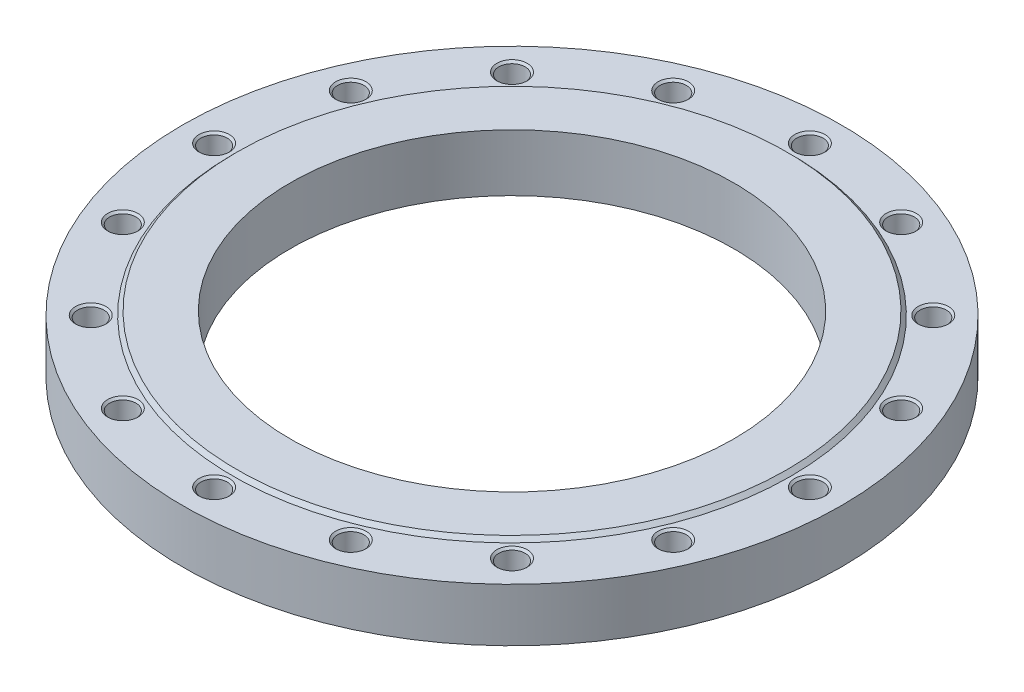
ISO-10303-21;
HEADER;
FILE_DESCRIPTION(('STEP AP214'),'2;1');
FILE_NAME('part.step','',(''),(''),'','','');
FILE_SCHEMA(('AUTOMOTIVE_DESIGN { 1 0 10303 214 1 1 1 1 }'));
ENDSEC;
DATA;
#1=APPLICATION_CONTEXT('core data for automotive mechanical design processes');
#2=APPLICATION_PROTOCOL_DEFINITION('international standard','automotive_design',2000,#1);
#3=PRODUCT_CONTEXT('',#1,'mechanical');
#4=PRODUCT('Part','Part','',(#3));
#5=PRODUCT_RELATED_PRODUCT_CATEGORY('part','',(#4));
#6=PRODUCT_DEFINITION_FORMATION('','',#4);
#7=PRODUCT_DEFINITION_CONTEXT('part definition',#1,'design');
#8=PRODUCT_DEFINITION('design','',#6,#7);
#9=PRODUCT_DEFINITION_SHAPE('','',#8);
#10=(LENGTH_UNIT() NAMED_UNIT(*) SI_UNIT(.MILLI.,.METRE.));
#11=(NAMED_UNIT(*) PLANE_ANGLE_UNIT() SI_UNIT($,.RADIAN.));
#12=(NAMED_UNIT(*) SI_UNIT($,.STERADIAN.) SOLID_ANGLE_UNIT());
#13=UNCERTAINTY_MEASURE_WITH_UNIT(LENGTH_MEASURE(1.E-05),#10,'distance_accuracy_value','');
#14=(GEOMETRIC_REPRESENTATION_CONTEXT(3) GLOBAL_UNCERTAINTY_ASSIGNED_CONTEXT((#13)) GLOBAL_UNIT_ASSIGNED_CONTEXT((#10,
#11,#12)) REPRESENTATION_CONTEXT('',''));
#15=CARTESIAN_POINT('',(0.,0.,0.));
#16=DIRECTION('',(0.,0.,1.));
#17=DIRECTION('',(1.,0.,0.));
#18=AXIS2_PLACEMENT_3D('',#15,#16,#17);
#19=CARTESIAN_POINT('',(0.,21.,0.));
#20=DIRECTION('',(0.,-1.,0.));
#21=DIRECTION('',(1.,0.,0.));
#22=AXIS2_PLACEMENT_3D('',#19,#20,#21);
#23=CYLINDRICAL_SURFACE('',#22,260.);
#24=CARTESIAN_POINT('',(0.,0.,0.));
#25=DIRECTION('',(0.,1.,0.));
#26=DIRECTION('',(1.,0.,0.));
#27=AXIS2_PLACEMENT_3D('',#24,#25,#26);
#28=CIRCLE('',#27,260.);
#29=CARTESIAN_POINT('',(260.,0.,0.));
#30=VERTEX_POINT('',#29);
#31=EDGE_CURVE('E9',#30,#30,#28,.T.);
#32=ORIENTED_EDGE('',*,*,#31,.T.);
#33=EDGE_LOOP('',(#32));
#34=FACE_BOUND('',#33,.T.);
#35=CARTESIAN_POINT('',(0.,42.,0.));
#36=DIRECTION('',(0.,1.,0.));
#37=DIRECTION('',(1.,0.,0.));
#38=AXIS2_PLACEMENT_3D('',#35,#36,#37);
#39=CIRCLE('',#38,260.);
#40=CARTESIAN_POINT('',(260.,42.,0.));
#41=VERTEX_POINT('',#40);
#42=EDGE_CURVE('E578',#41,#41,#39,.T.);
#43=ORIENTED_EDGE('',*,*,#42,.F.);
#44=EDGE_LOOP('',(#43));
#45=FACE_BOUND('',#44,.T.);
#46=ADVANCED_FACE('F15',(#34,#45),#23,.T.);
#47=CARTESIAN_POINT('',(217.5,0.,0.));
#48=DIRECTION('',(0.,-1.,0.));
#49=DIRECTION('',(-1.,0.,0.));
#50=AXIS2_PLACEMENT_3D('',#47,#48,#49);
#51=PLANE('',#50);
#52=CARTESIAN_POINT('',(0.,0.,0.));
#53=DIRECTION('',(0.,1.,0.));
#54=DIRECTION('',(1.,0.,0.));
#55=AXIS2_PLACEMENT_3D('',#52,#53,#54);
#56=CIRCLE('',#55,175.);
#57=CARTESIAN_POINT('',(175.,0.,0.));
#58=VERTEX_POINT('',#57);
#59=EDGE_CURVE('E24',#58,#58,#56,.T.);
#60=ORIENTED_EDGE('',*,*,#59,.T.);
#61=EDGE_LOOP('',(#60));
#62=FACE_BOUND('',#61,.T.);
#63=ORIENTED_EDGE('',*,*,#31,.F.);
#64=EDGE_LOOP('',(#63));
#65=FACE_BOUND('',#64,.T.);
#66=ADVANCED_FACE('F17',(#62,#65),#51,.T.);
#67=CARTESIAN_POINT('',(0.,22.5,0.));
#68=DIRECTION('',(0.,-1.,0.));
#69=DIRECTION('',(1.,0.,0.));
#70=AXIS2_PLACEMENT_3D('',#67,#68,#69);
#71=CYLINDRICAL_SURFACE('',#70,175.);
#72=CARTESIAN_POINT('',(0.,45.,0.));
#73=DIRECTION('',(0.,1.,0.));
#74=DIRECTION('',(1.,0.,0.));
#75=AXIS2_PLACEMENT_3D('',#72,#73,#74);
#76=CIRCLE('',#75,175.);
#77=CARTESIAN_POINT('',(175.,45.,0.));
#78=VERTEX_POINT('',#77);
#79=EDGE_CURVE('E498',#78,#78,#76,.T.);
#80=ORIENTED_EDGE('',*,*,#79,.T.);
#81=EDGE_LOOP('',(#80));
#82=FACE_BOUND('',#81,.T.);
#83=ORIENTED_EDGE('',*,*,#59,.F.);
#84=EDGE_LOOP('',(#83));
#85=FACE_BOUND('',#84,.T.);
#86=ADVANCED_FACE('F584',(#82,#85),#71,.F.);
#87=CARTESIAN_POINT('',(196.,45.,0.));
#88=DIRECTION('',(0.,1.,0.));
#89=DIRECTION('',(1.,0.,0.));
#90=AXIS2_PLACEMENT_3D('',#87,#88,#89);
#91=PLANE('',#90);
#92=CARTESIAN_POINT('',(0.,45.,0.));
#93=DIRECTION('',(0.,1.,0.));
#94=DIRECTION('',(1.,0.,0.));
#95=AXIS2_PLACEMENT_3D('',#92,#93,#94);
#96=CIRCLE('',#95,217.);
#97=CARTESIAN_POINT('',(217.,45.,0.));
#98=VERTEX_POINT('',#97);
#99=EDGE_CURVE('E580',#98,#98,#96,.T.);
#100=ORIENTED_EDGE('',*,*,#99,.T.);
#101=EDGE_LOOP('',(#100));
#102=FACE_BOUND('',#101,.T.);
#103=ORIENTED_EDGE('',*,*,#79,.F.);
#104=EDGE_LOOP('',(#103));
#105=FACE_BOUND('',#104,.T.);
#106=ADVANCED_FACE('F587',(#102,#105),#91,.T.);
#107=CARTESIAN_POINT('',(0.,43.5,0.));
#108=DIRECTION('',(0.,-1.,0.));
#109=DIRECTION('',(1.,0.,0.));
#110=AXIS2_PLACEMENT_3D('',#107,#108,#109);
#111=CONICAL_SURFACE('',#110,218.5,0.785398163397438);
#112=CARTESIAN_POINT('',(0.,42.,0.));
#113=DIRECTION('',(0.,1.,0.));
#114=DIRECTION('',(1.,0.,0.));
#115=AXIS2_PLACEMENT_3D('',#112,#113,#114);
#116=CIRCLE('',#115,220.);
#117=CARTESIAN_POINT('',(220.,42.,0.));
#118=VERTEX_POINT('',#117);
#119=EDGE_CURVE('E469',#118,#118,#116,.T.);
#120=ORIENTED_EDGE('',*,*,#119,.T.);
#121=EDGE_LOOP('',(#120));
#122=FACE_BOUND('',#121,.T.);
#123=ORIENTED_EDGE('',*,*,#99,.F.);
#124=EDGE_LOOP('',(#123));
#125=FACE_BOUND('',#124,.T.);
#126=ADVANCED_FACE('F589',(#122,#125),#111,.T.);
#127=CARTESIAN_POINT('',(240.,42.,0.));
#128=DIRECTION('',(0.,1.,0.));
#129=DIRECTION('',(1.,0.,0.));
#130=AXIS2_PLACEMENT_3D('',#127,#128,#129);
#131=PLANE('',#130);
#132=ORIENTED_EDGE('',*,*,#42,.T.);
#133=EDGE_LOOP('',(#132));
#134=FACE_BOUND('',#133,.T.);
#135=ORIENTED_EDGE('',*,*,#119,.F.);
#136=EDGE_LOOP('',(#135));
#137=FACE_BOUND('',#136,.T.);
#138=CARTESIAN_POINT('',(235.,42.,0.));
#139=DIRECTION('',(0.,-1.,0.));
#140=DIRECTION('',(1.,0.,0.));
#141=AXIS2_PLACEMENT_3D('',#138,#139,#140);
#142=CIRCLE('',#141,12.);
#143=CARTESIAN_POINT('',(247.,42.,0.));
#144=VERTEX_POINT('',#143);
#145=EDGE_CURVE('E477',#144,#144,#142,.T.);
#146=ORIENTED_EDGE('',*,*,#145,.T.);
#147=EDGE_LOOP('',(#146));
#148=FACE_BOUND('',#147,.T.);
#149=CARTESIAN_POINT('',(217.111690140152,42.,-89.9306066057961));
#150=DIRECTION('',(0.,-1.,0.));
#151=DIRECTION('',(0.923879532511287,0.,-0.38268343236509));
#152=AXIS2_PLACEMENT_3D('',#149,#150,#151);
#153=CIRCLE('',#152,12.);
#154=CARTESIAN_POINT('',(228.198244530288,42.,-94.5228077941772));
#155=VERTEX_POINT('',#154);
#156=EDGE_CURVE('E441',#155,#155,#153,.T.);
#157=ORIENTED_EDGE('',*,*,#156,.T.);
#158=EDGE_LOOP('',(#157));
#159=FACE_BOUND('',#158,.T.);
#160=CARTESIAN_POINT('',(166.170093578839,42.,-166.170093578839));
#161=DIRECTION('',(0.,-1.,0.));
#162=DIRECTION('',(0.707106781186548,0.,-0.707106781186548));
#163=AXIS2_PLACEMENT_3D('',#160,#161,#162);
#164=CIRCLE('',#163,12.);
#165=CARTESIAN_POINT('',(174.655374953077,42.,-174.655374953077));
#166=VERTEX_POINT('',#165);
#167=EDGE_CURVE('E424',#166,#166,#164,.T.);
#168=ORIENTED_EDGE('',*,*,#167,.T.);
#169=EDGE_LOOP('',(#168));
#170=FACE_BOUND('',#169,.T.);
#171=CARTESIAN_POINT('',(89.9306066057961,42.,-217.111690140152));
#172=DIRECTION('',(0.,-1.,0.));
#173=DIRECTION('',(0.38268343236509,0.,-0.923879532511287));
#174=AXIS2_PLACEMENT_3D('',#171,#172,#173);
#175=CIRCLE('',#174,12.);
#176=CARTESIAN_POINT('',(94.5228077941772,42.,-228.198244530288));
#177=VERTEX_POINT('',#176);
#178=EDGE_CURVE('E526',#177,#177,#175,.T.);
#179=ORIENTED_EDGE('',*,*,#178,.T.);
#180=EDGE_LOOP('',(#179));
#181=FACE_BOUND('',#180,.T.);
#182=CARTESIAN_POINT('',(0.,42.,-235.));
#183=DIRECTION('',(0.,-1.,0.));
#184=DIRECTION('',(0.,0.,-1.));
#185=AXIS2_PLACEMENT_3D('',#182,#183,#184);
#186=CIRCLE('',#185,12.);
#187=CARTESIAN_POINT('',(0.,42.,-247.));
#188=VERTEX_POINT('',#187);
#189=EDGE_CURVE('E386',#188,#188,#186,.T.);
#190=ORIENTED_EDGE('',*,*,#189,.T.);
#191=EDGE_LOOP('',(#190));
#192=FACE_BOUND('',#191,.T.);
#193=CARTESIAN_POINT('',(-89.9306066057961,42.,-217.111690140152));
#194=DIRECTION('',(0.,-1.,0.));
#195=DIRECTION('',(-0.38268343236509,0.,-0.923879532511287));
#196=AXIS2_PLACEMENT_3D('',#193,#194,#195);
#197=CIRCLE('',#196,12.);
#198=CARTESIAN_POINT('',(-94.5228077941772,42.,-228.198244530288));
#199=VERTEX_POINT('',#198);
#200=EDGE_CURVE('E549',#199,#199,#197,.T.);
#201=ORIENTED_EDGE('',*,*,#200,.T.);
#202=EDGE_LOOP('',(#201));
#203=FACE_BOUND('',#202,.T.);
#204=CARTESIAN_POINT('',(-166.170093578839,42.,-166.170093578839));
#205=DIRECTION('',(0.,-1.,0.));
#206=DIRECTION('',(-0.707106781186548,0.,-0.707106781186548));
#207=AXIS2_PLACEMENT_3D('',#204,#205,#206);
#208=CIRCLE('',#207,12.);
#209=CARTESIAN_POINT('',(-174.655374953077,42.,-174.655374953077));
#210=VERTEX_POINT('',#209);
#211=EDGE_CURVE('E537',#210,#210,#208,.T.);
#212=ORIENTED_EDGE('',*,*,#211,.T.);
#213=EDGE_LOOP('',(#212));
#214=FACE_BOUND('',#213,.T.);
#215=CARTESIAN_POINT('',(-217.111690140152,42.,-89.9306066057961));
#216=DIRECTION('',(0.,-1.,0.));
#217=DIRECTION('',(-0.923879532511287,0.,-0.38268343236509));
#218=AXIS2_PLACEMENT_3D('',#215,#216,#217);
#219=CIRCLE('',#218,12.);
#220=CARTESIAN_POINT('',(-228.198244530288,42.,-94.5228077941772));
#221=VERTEX_POINT('',#220);
#222=EDGE_CURVE('E432',#221,#221,#219,.T.);
#223=ORIENTED_EDGE('',*,*,#222,.T.);
#224=EDGE_LOOP('',(#223));
#225=FACE_BOUND('',#224,.T.);
#226=CARTESIAN_POINT('',(-235.,42.,0.));
#227=DIRECTION('',(0.,-1.,0.));
#228=DIRECTION('',(-1.,0.,0.));
#229=AXIS2_PLACEMENT_3D('',#226,#227,#228);
#230=CIRCLE('',#229,12.);
#231=CARTESIAN_POINT('',(-247.,42.,0.));
#232=VERTEX_POINT('',#231);
#233=EDGE_CURVE('E399',#232,#232,#230,.T.);
#234=ORIENTED_EDGE('',*,*,#233,.T.);
#235=EDGE_LOOP('',(#234));
#236=FACE_BOUND('',#235,.T.);
#237=CARTESIAN_POINT('',(-217.111690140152,42.,89.9306066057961));
#238=DIRECTION('',(0.,-1.,0.));
#239=DIRECTION('',(-0.923879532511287,0.,0.38268343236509));
#240=AXIS2_PLACEMENT_3D('',#237,#238,#239);
#241=CIRCLE('',#240,12.);
#242=CARTESIAN_POINT('',(-228.198244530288,42.,94.5228077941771));
#243=VERTEX_POINT('',#242);
#244=EDGE_CURVE('E517',#243,#243,#241,.T.);
#245=ORIENTED_EDGE('',*,*,#244,.T.);
#246=EDGE_LOOP('',(#245));
#247=FACE_BOUND('',#246,.T.);
#248=CARTESIAN_POINT('',(-166.170093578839,42.,166.170093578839));
#249=DIRECTION('',(0.,-1.,0.));
#250=DIRECTION('',(-0.707106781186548,0.,0.707106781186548));
#251=AXIS2_PLACEMENT_3D('',#248,#249,#250);
#252=CIRCLE('',#251,12.);
#253=CARTESIAN_POINT('',(-174.655374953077,42.,174.655374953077));
#254=VERTEX_POINT('',#253);
#255=EDGE_CURVE('E500',#254,#254,#252,.T.);
#256=ORIENTED_EDGE('',*,*,#255,.T.);
#257=EDGE_LOOP('',(#256));
#258=FACE_BOUND('',#257,.T.);
#259=CARTESIAN_POINT('',(-89.9306066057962,42.,217.111690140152));
#260=DIRECTION('',(0.,-1.,0.));
#261=DIRECTION('',(-0.382683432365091,0.,0.923879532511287));
#262=AXIS2_PLACEMENT_3D('',#259,#260,#261);
#263=CIRCLE('',#262,12.);
#264=CARTESIAN_POINT('',(-94.5228077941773,42.,228.198244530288));
#265=VERTEX_POINT('',#264);
#266=EDGE_CURVE('E483',#265,#265,#263,.T.);
#267=ORIENTED_EDGE('',*,*,#266,.T.);
#268=EDGE_LOOP('',(#267));
#269=FACE_BOUND('',#268,.T.);
#270=CARTESIAN_POINT('',(0.,42.,235.));
#271=DIRECTION('',(0.,-1.,0.));
#272=DIRECTION('',(0.,0.,1.));
#273=AXIS2_PLACEMENT_3D('',#270,#271,#272);
#274=CIRCLE('',#273,12.);
#275=CARTESIAN_POINT('',(0.,42.,247.));
#276=VERTEX_POINT('',#275);
#277=EDGE_CURVE('E457',#276,#276,#274,.T.);
#278=ORIENTED_EDGE('',*,*,#277,.T.);
#279=EDGE_LOOP('',(#278));
#280=FACE_BOUND('',#279,.T.);
#281=CARTESIAN_POINT('',(89.9306066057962,42.,217.111690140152));
#282=DIRECTION('',(0.,-1.,0.));
#283=DIRECTION('',(0.38268343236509,0.,0.923879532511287));
#284=AXIS2_PLACEMENT_3D('',#281,#282,#283);
#285=CIRCLE('',#284,12.);
#286=CARTESIAN_POINT('',(94.5228077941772,42.,228.198244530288));
#287=VERTEX_POINT('',#286);
#288=EDGE_CURVE('E405',#287,#287,#285,.T.);
#289=ORIENTED_EDGE('',*,*,#288,.T.);
#290=EDGE_LOOP('',(#289));
#291=FACE_BOUND('',#290,.T.);
#292=CARTESIAN_POINT('',(166.170093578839,42.,166.170093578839));
#293=DIRECTION('',(0.,-1.,0.));
#294=DIRECTION('',(0.707106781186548,0.,0.707106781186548));
#295=AXIS2_PLACEMENT_3D('',#292,#293,#294);
#296=CIRCLE('',#295,12.);
#297=CARTESIAN_POINT('',(174.655374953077,42.,174.655374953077));
#298=VERTEX_POINT('',#297);
#299=EDGE_CURVE('E414',#298,#298,#296,.T.);
#300=ORIENTED_EDGE('',*,*,#299,.T.);
#301=EDGE_LOOP('',(#300));
#302=FACE_BOUND('',#301,.T.);
#303=CARTESIAN_POINT('',(217.111690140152,42.,89.9306066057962));
#304=DIRECTION('',(0.,-1.,0.));
#305=DIRECTION('',(0.923879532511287,0.,0.382683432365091));
#306=AXIS2_PLACEMENT_3D('',#303,#304,#305);
#307=CIRCLE('',#306,12.);
#308=CARTESIAN_POINT('',(228.198244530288,42.,94.5228077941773));
#309=VERTEX_POINT('',#308);
#310=EDGE_CURVE('E390',#309,#309,#307,.T.);
#311=ORIENTED_EDGE('',*,*,#310,.T.);
#312=EDGE_LOOP('',(#311));
#313=FACE_BOUND('',#312,.T.);
#314=ADVANCED_FACE('F597',(#134,#137,#148,#159,#170,#181,#192,#203,#214,#225,#236,#247,#258,
#269,#280,#291,#302,#313),#131,.T.);
#315=CARTESIAN_POINT('',(235.,6.00463463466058,0.));
#316=DIRECTION('',(0.,1.,0.));
#317=DIRECTION('',(1.,0.,0.));
#318=AXIS2_PLACEMENT_3D('',#315,#316,#317);
#319=CONICAL_SURFACE('',#318,5.188125,1.0471975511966);
#320=CARTESIAN_POINT('',(235.,9.,0.));
#321=DIRECTION('',(0.,-1.,0.));
#322=DIRECTION('',(1.,0.,0.));
#323=AXIS2_PLACEMENT_3D('',#320,#321,#322);
#324=CIRCLE('',#323,10.37625);
#325=CARTESIAN_POINT('',(245.37625,9.,0.));
#326=VERTEX_POINT('',#325);
#327=EDGE_CURVE('E467',#326,#326,#324,.T.);
#328=ORIENTED_EDGE('',*,*,#327,.F.);
#329=EDGE_LOOP('',(#328));
#330=FACE_BOUND('',#329,.T.);
#331=CARTESIAN_POINT('',(235.,3.00926926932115,0.));
#332=VERTEX_POINT('',#331);
#333=VERTEX_LOOP('',#332);
#334=FACE_BOUND('',#333,.T.);
#335=ADVANCED_FACE('F690',(#330,#334),#319,.F.);
#336=CARTESIAN_POINT('',(235.,12.688125,0.));
#337=DIRECTION('',(0.,1.,0.));
#338=DIRECTION('',(1.,0.,0.));
#339=AXIS2_PLACEMENT_3D('',#336,#337,#338);
#340=CYLINDRICAL_SURFACE('',#339,10.37625);
#341=CARTESIAN_POINT('',(235.,16.37625,0.));
#342=DIRECTION('',(0.,-1.,0.));
#343=DIRECTION('',(1.,0.,0.));
#344=AXIS2_PLACEMENT_3D('',#341,#342,#343);
#345=CIRCLE('',#344,10.37625);
#346=CARTESIAN_POINT('',(245.37625,16.37625,0.));
#347=VERTEX_POINT('',#346);
#348=EDGE_CURVE('E393',#347,#347,#345,.T.);
#349=ORIENTED_EDGE('',*,*,#348,.F.);
#350=EDGE_LOOP('',(#349));
#351=FACE_BOUND('',#350,.T.);
#352=ORIENTED_EDGE('',*,*,#327,.T.);
#353=EDGE_LOOP('',(#352));
#354=FACE_BOUND('',#353,.T.);
#355=ADVANCED_FACE('F686',(#351,#354),#340,.F.);
#356=CARTESIAN_POINT('',(235.,17.188125,0.));
#357=DIRECTION('',(0.,1.,0.));
#358=DIRECTION('',(1.,0.,0.));
#359=AXIS2_PLACEMENT_3D('',#356,#357,#358);
#360=CONICAL_SURFACE('',#359,11.188125,0.785398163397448);
#361=CARTESIAN_POINT('',(235.,18.,0.));
#362=DIRECTION('',(0.,-1.,0.));
#363=DIRECTION('',(1.,0.,0.));
#364=AXIS2_PLACEMENT_3D('',#361,#362,#363);
#365=CIRCLE('',#364,12.);
#366=CARTESIAN_POINT('',(247.,18.,0.));
#367=VERTEX_POINT('',#366);
#368=EDGE_CURVE('E391',#367,#367,#365,.T.);
#369=ORIENTED_EDGE('',*,*,#368,.F.);
#370=EDGE_LOOP('',(#369));
#371=FACE_BOUND('',#370,.T.);
#372=ORIENTED_EDGE('',*,*,#348,.T.);
#373=EDGE_LOOP('',(#372));
#374=FACE_BOUND('',#373,.T.);
#375=ADVANCED_FACE('F689',(#371,#374),#360,.F.);
#376=CARTESIAN_POINT('',(246.188125,18.,0.));
#377=DIRECTION('',(0.,1.,0.));
#378=DIRECTION('',(-1.,0.,0.));
#379=AXIS2_PLACEMENT_3D('',#376,#377,#378);
#380=PLANE('',#379);
#381=CARTESIAN_POINT('',(235.,18.,0.));
#382=DIRECTION('',(0.,-1.,0.));
#383=DIRECTION('',(1.,0.,0.));
#384=AXIS2_PLACEMENT_3D('',#381,#382,#383);
#385=CIRCLE('',#384,10.37625);
#386=CARTESIAN_POINT('',(245.37625,18.,0.));
#387=VERTEX_POINT('',#386);
#388=EDGE_CURVE('E394',#387,#387,#385,.T.);
#389=ORIENTED_EDGE('',*,*,#388,.F.);
#390=EDGE_LOOP('',(#389));
#391=FACE_BOUND('',#390,.T.);
#392=ORIENTED_EDGE('',*,*,#368,.T.);
#393=EDGE_LOOP('',(#392));
#394=FACE_BOUND('',#393,.T.);
#395=ADVANCED_FACE('F943',(#391,#394),#380,.F.);
#396=CARTESIAN_POINT('',(235.,29.188125,0.));
#397=DIRECTION('',(0.,1.,0.));
#398=DIRECTION('',(1.,0.,0.));
#399=AXIS2_PLACEMENT_3D('',#396,#397,#398);
#400=CYLINDRICAL_SURFACE('',#399,10.37625);
#401=CARTESIAN_POINT('',(235.,40.37625,0.));
#402=DIRECTION('',(0.,-1.,0.));
#403=DIRECTION('',(1.,0.,0.));
#404=AXIS2_PLACEMENT_3D('',#401,#402,#403);
#405=CIRCLE('',#404,10.37625);
#406=CARTESIAN_POINT('',(245.37625,40.37625,0.));
#407=VERTEX_POINT('',#406);
#408=EDGE_CURVE('E511',#407,#407,#405,.T.);
#409=ORIENTED_EDGE('',*,*,#408,.F.);
#410=EDGE_LOOP('',(#409));
#411=FACE_BOUND('',#410,.T.);
#412=ORIENTED_EDGE('',*,*,#388,.T.);
#413=EDGE_LOOP('',(#412));
#414=FACE_BOUND('',#413,.T.);
#415=ADVANCED_FACE('F778',(#411,#414),#400,.F.);
#416=CARTESIAN_POINT('',(235.,41.188125,0.));
#417=DIRECTION('',(0.,1.,0.));
#418=DIRECTION('',(1.,0.,0.));
#419=AXIS2_PLACEMENT_3D('',#416,#417,#418);
#420=CONICAL_SURFACE('',#419,11.188125,0.785398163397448);
#421=ORIENTED_EDGE('',*,*,#145,.F.);
#422=EDGE_LOOP('',(#421));
#423=FACE_BOUND('',#422,.T.);
#424=ORIENTED_EDGE('',*,*,#408,.T.);
#425=EDGE_LOOP('',(#424));
#426=FACE_BOUND('',#425,.T.);
#427=ADVANCED_FACE('F775',(#423,#426),#420,.F.);
#428=CARTESIAN_POINT('',(217.111690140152,6.00463463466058,-89.9306066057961));
#429=DIRECTION('',(0.,1.,0.));
#430=DIRECTION('',(0.923879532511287,0.,-0.38268343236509));
#431=AXIS2_PLACEMENT_3D('',#428,#429,#430);
#432=CONICAL_SURFACE('',#431,5.188125,1.0471975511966);
#433=CARTESIAN_POINT('',(217.111690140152,9.,-89.9306066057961));
#434=DIRECTION('',(0.,-1.,0.));
#435=DIRECTION('',(0.923879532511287,0.,-0.38268343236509));
#436=AXIS2_PLACEMENT_3D('',#433,#434,#435);
#437=CIRCLE('',#436,10.37625);
#438=CARTESIAN_POINT('',(226.698095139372,9.,-93.9014255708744));
#439=VERTEX_POINT('',#438);
#440=EDGE_CURVE('E509',#439,#439,#437,.T.);
#441=ORIENTED_EDGE('',*,*,#440,.F.);
#442=EDGE_LOOP('',(#441));
#443=FACE_BOUND('',#442,.T.);
#444=CARTESIAN_POINT('',(217.111690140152,3.00926926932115,-89.9306066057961));
#445=VERTEX_POINT('',#444);
#446=VERTEX_LOOP('',#445);
#447=FACE_BOUND('',#446,.T.);
#448=ADVANCED_FACE('F773',(#443,#447),#432,.F.);
#449=CARTESIAN_POINT('',(217.111690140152,12.688125,-89.9306066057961));
#450=DIRECTION('',(0.,1.,0.));
#451=DIRECTION('',(0.923879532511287,0.,-0.38268343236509));
#452=AXIS2_PLACEMENT_3D('',#449,#450,#451);
#453=CYLINDRICAL_SURFACE('',#452,10.37625);
#454=CARTESIAN_POINT('',(217.111690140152,16.37625,-89.9306066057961));
#455=DIRECTION('',(0.,-1.,0.));
#456=DIRECTION('',(0.923879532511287,0.,-0.38268343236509));
#457=AXIS2_PLACEMENT_3D('',#454,#455,#456);
#458=CIRCLE('',#457,10.37625);
#459=CARTESIAN_POINT('',(226.698095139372,16.37625,-93.9014255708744));
#460=VERTEX_POINT('',#459);
#461=EDGE_CURVE('E453',#460,#460,#458,.T.);
#462=ORIENTED_EDGE('',*,*,#461,.F.);
#463=EDGE_LOOP('',(#462));
#464=FACE_BOUND('',#463,.T.);
#465=ORIENTED_EDGE('',*,*,#440,.T.);
#466=EDGE_LOOP('',(#465));
#467=FACE_BOUND('',#466,.T.);
#468=ADVANCED_FACE('F769',(#464,#467),#453,.F.);
#469=CARTESIAN_POINT('',(217.111690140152,17.188125,-89.9306066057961));
#470=DIRECTION('',(0.,1.,0.));
#471=DIRECTION('',(0.923879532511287,0.,-0.38268343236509));
#472=AXIS2_PLACEMENT_3D('',#469,#470,#471);
#473=CONICAL_SURFACE('',#472,11.188125,0.785398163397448);
#474=CARTESIAN_POINT('',(217.111690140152,18.,-89.9306066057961));
#475=DIRECTION('',(0.,-1.,0.));
#476=DIRECTION('',(0.923879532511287,0.,-0.38268343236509));
#477=AXIS2_PLACEMENT_3D('',#474,#475,#476);
#478=CIRCLE('',#477,12.);
#479=CARTESIAN_POINT('',(228.198244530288,18.,-94.5228077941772));
#480=VERTEX_POINT('',#479);
#481=EDGE_CURVE('E451',#480,#480,#478,.T.);
#482=ORIENTED_EDGE('',*,*,#481,.F.);
#483=EDGE_LOOP('',(#482));
#484=FACE_BOUND('',#483,.T.);
#485=ORIENTED_EDGE('',*,*,#461,.T.);
#486=EDGE_LOOP('',(#485));
#487=FACE_BOUND('',#486,.T.);
#488=ADVANCED_FACE('F772',(#484,#487),#473,.F.);
#489=CARTESIAN_POINT('',(227.448169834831,18.,-94.2121166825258));
#490=DIRECTION('',(0.,1.,0.));
#491=DIRECTION('',(-0.923879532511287,0.,0.38268343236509));
#492=AXIS2_PLACEMENT_3D('',#489,#490,#491);
#493=PLANE('',#492);
#494=CARTESIAN_POINT('',(217.111690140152,18.,-89.9306066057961));
#495=DIRECTION('',(0.,-1.,0.));
#496=DIRECTION('',(0.923879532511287,0.,-0.38268343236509));
#497=AXIS2_PLACEMENT_3D('',#494,#495,#496);
#498=CIRCLE('',#497,10.37625);
#499=CARTESIAN_POINT('',(226.698095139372,18.,-93.9014255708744));
#500=VERTEX_POINT('',#499);
#501=EDGE_CURVE('E443',#500,#500,#498,.T.);
#502=ORIENTED_EDGE('',*,*,#501,.F.);
#503=EDGE_LOOP('',(#502));
#504=FACE_BOUND('',#503,.T.);
#505=ORIENTED_EDGE('',*,*,#481,.T.);
#506=EDGE_LOOP('',(#505));
#507=FACE_BOUND('',#506,.T.);
#508=ADVANCED_FACE('F654',(#504,#507),#493,.F.);
#509=CARTESIAN_POINT('',(217.111690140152,29.188125,-89.9306066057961));
#510=DIRECTION('',(0.,1.,0.));
#511=DIRECTION('',(0.923879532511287,0.,-0.38268343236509));
#512=AXIS2_PLACEMENT_3D('',#509,#510,#511);
#513=CYLINDRICAL_SURFACE('',#512,10.37625);
#514=CARTESIAN_POINT('',(217.111690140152,40.37625,-89.9306066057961));
#515=DIRECTION('',(0.,-1.,0.));
#516=DIRECTION('',(0.923879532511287,0.,-0.38268343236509));
#517=AXIS2_PLACEMENT_3D('',#514,#515,#516);
#518=CIRCLE('',#517,10.37625);
#519=CARTESIAN_POINT('',(226.698095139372,40.37625,-93.9014255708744));
#520=VERTEX_POINT('',#519);
#521=EDGE_CURVE('E444',#520,#520,#518,.T.);
#522=ORIENTED_EDGE('',*,*,#521,.F.);
#523=EDGE_LOOP('',(#522));
#524=FACE_BOUND('',#523,.T.);
#525=ORIENTED_EDGE('',*,*,#501,.T.);
#526=EDGE_LOOP('',(#525));
#527=FACE_BOUND('',#526,.T.);
#528=ADVANCED_FACE('F650',(#524,#527),#513,.F.);
#529=CARTESIAN_POINT('',(217.111690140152,41.188125,-89.9306066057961));
#530=DIRECTION('',(0.,1.,0.));
#531=DIRECTION('',(0.923879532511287,0.,-0.38268343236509));
#532=AXIS2_PLACEMENT_3D('',#529,#530,#531);
#533=CONICAL_SURFACE('',#532,11.188125,0.785398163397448);
#534=ORIENTED_EDGE('',*,*,#156,.F.);
#535=EDGE_LOOP('',(#534));
#536=FACE_BOUND('',#535,.T.);
#537=ORIENTED_EDGE('',*,*,#521,.T.);
#538=EDGE_LOOP('',(#537));
#539=FACE_BOUND('',#538,.T.);
#540=ADVANCED_FACE('F653',(#536,#539),#533,.F.);
#541=CARTESIAN_POINT('',(166.170093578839,6.00463463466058,-166.170093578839));
#542=DIRECTION('',(0.,1.,0.));
#543=DIRECTION('',(0.707106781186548,0.,-0.707106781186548));
#544=AXIS2_PLACEMENT_3D('',#541,#542,#543);
#545=CONICAL_SURFACE('',#544,5.188125,1.0471975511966);
#546=CARTESIAN_POINT('',(166.170093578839,9.,-166.170093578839));
#547=DIRECTION('',(0.,-1.,0.));
#548=DIRECTION('',(0.707106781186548,0.,-0.707106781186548));
#549=AXIS2_PLACEMENT_3D('',#546,#547,#548);
#550=CIRCLE('',#549,10.37625);
#551=CARTESIAN_POINT('',(173.507210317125,9.,-173.507210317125));
#552=VERTEX_POINT('',#551);
#553=EDGE_CURVE('E562',#552,#552,#550,.T.);
#554=ORIENTED_EDGE('',*,*,#553,.F.);
#555=EDGE_LOOP('',(#554));
#556=FACE_BOUND('',#555,.T.);
#557=CARTESIAN_POINT('',(166.170093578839,3.00926926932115,-166.170093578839));
#558=VERTEX_POINT('',#557);
#559=VERTEX_LOOP('',#558);
#560=FACE_BOUND('',#559,.T.);
#561=ADVANCED_FACE('F724',(#556,#560),#545,.F.);
#562=CARTESIAN_POINT('',(166.170093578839,12.688125,-166.170093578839));
#563=DIRECTION('',(0.,1.,0.));
#564=DIRECTION('',(0.707106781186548,0.,-0.707106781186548));
#565=AXIS2_PLACEMENT_3D('',#562,#563,#564);
#566=CYLINDRICAL_SURFACE('',#565,10.37625);
#567=CARTESIAN_POINT('',(166.170093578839,16.37625,-166.170093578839));
#568=DIRECTION('',(0.,-1.,0.));
#569=DIRECTION('',(0.707106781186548,0.,-0.707106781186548));
#570=AXIS2_PLACEMENT_3D('',#567,#568,#569);
#571=CIRCLE('',#570,10.37625);
#572=CARTESIAN_POINT('',(173.507210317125,16.37625,-173.507210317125));
#573=VERTEX_POINT('',#572);
#574=EDGE_CURVE('E560',#573,#573,#571,.T.);
#575=ORIENTED_EDGE('',*,*,#574,.F.);
#576=EDGE_LOOP('',(#575));
#577=FACE_BOUND('',#576,.T.);
#578=ORIENTED_EDGE('',*,*,#553,.T.);
#579=EDGE_LOOP('',(#578));
#580=FACE_BOUND('',#579,.T.);
#581=ADVANCED_FACE('F764',(#577,#580),#566,.F.);
#582=CARTESIAN_POINT('',(166.170093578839,17.188125,-166.170093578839));
#583=DIRECTION('',(0.,1.,0.));
#584=DIRECTION('',(0.707106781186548,0.,-0.707106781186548));
#585=AXIS2_PLACEMENT_3D('',#582,#583,#584);
#586=CONICAL_SURFACE('',#585,11.188125,0.785398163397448);
#587=CARTESIAN_POINT('',(166.170093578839,18.,-166.170093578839));
#588=DIRECTION('',(0.,-1.,0.));
#589=DIRECTION('',(0.707106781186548,0.,-0.707106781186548));
#590=AXIS2_PLACEMENT_3D('',#587,#588,#589);
#591=CIRCLE('',#590,12.);
#592=CARTESIAN_POINT('',(174.655374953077,18.,-174.655374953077));
#593=VERTEX_POINT('',#592);
#594=EDGE_CURVE('E423',#593,#593,#591,.T.);
#595=ORIENTED_EDGE('',*,*,#594,.F.);
#596=EDGE_LOOP('',(#595));
#597=FACE_BOUND('',#596,.T.);
#598=ORIENTED_EDGE('',*,*,#574,.T.);
#599=EDGE_LOOP('',(#598));
#600=FACE_BOUND('',#599,.T.);
#601=ADVANCED_FACE('F767',(#597,#600),#586,.F.);
#602=CARTESIAN_POINT('',(174.081292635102,18.,-174.081292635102));
#603=DIRECTION('',(0.,1.,0.));
#604=DIRECTION('',(-0.707106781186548,0.,0.707106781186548));
#605=AXIS2_PLACEMENT_3D('',#602,#603,#604);
#606=PLANE('',#605);
#607=CARTESIAN_POINT('',(166.170093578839,18.,-166.170093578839));
#608=DIRECTION('',(0.,-1.,0.));
#609=DIRECTION('',(0.707106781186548,0.,-0.707106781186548));
#610=AXIS2_PLACEMENT_3D('',#607,#608,#609);
#611=CIRCLE('',#610,10.37625);
#612=CARTESIAN_POINT('',(173.507210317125,18.,-173.507210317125));
#613=VERTEX_POINT('',#612);
#614=EDGE_CURVE('E421',#613,#613,#611,.T.);
#615=ORIENTED_EDGE('',*,*,#614,.F.);
#616=EDGE_LOOP('',(#615));
#617=FACE_BOUND('',#616,.T.);
#618=ORIENTED_EDGE('',*,*,#594,.T.);
#619=EDGE_LOOP('',(#618));
#620=FACE_BOUND('',#619,.T.);
#621=ADVANCED_FACE('F762',(#617,#620),#606,.F.);
#622=CARTESIAN_POINT('',(166.170093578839,29.188125,-166.170093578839));
#623=DIRECTION('',(0.,1.,0.));
#624=DIRECTION('',(0.707106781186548,0.,-0.707106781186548));
#625=AXIS2_PLACEMENT_3D('',#622,#623,#624);
#626=CYLINDRICAL_SURFACE('',#625,10.37625);
#627=CARTESIAN_POINT('',(166.170093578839,40.37625,-166.170093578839));
#628=DIRECTION('',(0.,-1.,0.));
#629=DIRECTION('',(0.707106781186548,0.,-0.707106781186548));
#630=AXIS2_PLACEMENT_3D('',#627,#628,#629);
#631=CIRCLE('',#630,10.37625);
#632=CARTESIAN_POINT('',(173.507210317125,40.37625,-173.507210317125));
#633=VERTEX_POINT('',#632);
#634=EDGE_CURVE('E484',#633,#633,#631,.T.);
#635=ORIENTED_EDGE('',*,*,#634,.F.);
#636=EDGE_LOOP('',(#635));
#637=FACE_BOUND('',#636,.T.);
#638=ORIENTED_EDGE('',*,*,#614,.T.);
#639=EDGE_LOOP('',(#638));
#640=FACE_BOUND('',#639,.T.);
#641=ADVANCED_FACE('F708',(#637,#640),#626,.F.);
#642=CARTESIAN_POINT('',(166.170093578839,41.188125,-166.170093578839));
#643=DIRECTION('',(0.,1.,0.));
#644=DIRECTION('',(0.707106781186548,0.,-0.707106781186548));
#645=AXIS2_PLACEMENT_3D('',#642,#643,#644);
#646=CONICAL_SURFACE('',#645,11.188125,0.785398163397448);
#647=ORIENTED_EDGE('',*,*,#167,.F.);
#648=EDGE_LOOP('',(#647));
#649=FACE_BOUND('',#648,.T.);
#650=ORIENTED_EDGE('',*,*,#634,.T.);
#651=EDGE_LOOP('',(#650));
#652=FACE_BOUND('',#651,.T.);
#653=ADVANCED_FACE('F704',(#649,#652),#646,.F.);
#654=CARTESIAN_POINT('',(89.9306066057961,6.00463463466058,-217.111690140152));
#655=DIRECTION('',(0.,1.,0.));
#656=DIRECTION('',(0.38268343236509,0.,-0.923879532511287));
#657=AXIS2_PLACEMENT_3D('',#654,#655,#656);
#658=CONICAL_SURFACE('',#657,5.188125,1.0471975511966);
#659=CARTESIAN_POINT('',(89.9306066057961,9.,-217.111690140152));
#660=DIRECTION('',(0.,-1.,0.));
#661=DIRECTION('',(0.38268343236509,0.,-0.923879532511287));
#662=AXIS2_PLACEMENT_3D('',#659,#660,#661);
#663=CIRCLE('',#662,10.37625);
#664=CARTESIAN_POINT('',(93.9014255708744,9.,-226.698095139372));
#665=VERTEX_POINT('',#664);
#666=EDGE_CURVE('E417',#665,#665,#663,.T.);
#667=ORIENTED_EDGE('',*,*,#666,.F.);
#668=EDGE_LOOP('',(#667));
#669=FACE_BOUND('',#668,.T.);
#670=CARTESIAN_POINT('',(89.9306066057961,3.00926926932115,-217.111690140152));
#671=VERTEX_POINT('',#670);
#672=VERTEX_LOOP('',#671);
#673=FACE_BOUND('',#672,.T.);
#674=ADVANCED_FACE('F707',(#669,#673),#658,.F.);
#675=CARTESIAN_POINT('',(89.9306066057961,12.688125,-217.111690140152));
#676=DIRECTION('',(0.,1.,0.));
#677=DIRECTION('',(0.38268343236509,0.,-0.923879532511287));
#678=AXIS2_PLACEMENT_3D('',#675,#676,#677);
#679=CYLINDRICAL_SURFACE('',#678,10.37625);
#680=CARTESIAN_POINT('',(89.9306066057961,16.37625,-217.111690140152));
#681=DIRECTION('',(0.,-1.,0.));
#682=DIRECTION('',(0.38268343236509,0.,-0.923879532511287));
#683=AXIS2_PLACEMENT_3D('',#680,#681,#682);
#684=CIRCLE('',#683,10.37625);
#685=CARTESIAN_POINT('',(93.9014255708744,16.37625,-226.698095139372));
#686=VERTEX_POINT('',#685);
#687=EDGE_CURVE('E415',#686,#686,#684,.T.);
#688=ORIENTED_EDGE('',*,*,#687,.F.);
#689=EDGE_LOOP('',(#688));
#690=FACE_BOUND('',#689,.T.);
#691=ORIENTED_EDGE('',*,*,#666,.T.);
#692=EDGE_LOOP('',(#691));
#693=FACE_BOUND('',#692,.T.);
#694=ADVANCED_FACE('F752',(#690,#693),#679,.F.);
#695=CARTESIAN_POINT('',(89.9306066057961,17.188125,-217.111690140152));
#696=DIRECTION('',(0.,1.,0.));
#697=DIRECTION('',(0.38268343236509,0.,-0.923879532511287));
#698=AXIS2_PLACEMENT_3D('',#695,#696,#697);
#699=CONICAL_SURFACE('',#698,11.188125,0.785398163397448);
#700=CARTESIAN_POINT('',(89.9306066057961,18.,-217.111690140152));
#701=DIRECTION('',(0.,-1.,0.));
#702=DIRECTION('',(0.38268343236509,0.,-0.923879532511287));
#703=AXIS2_PLACEMENT_3D('',#700,#701,#702);
#704=CIRCLE('',#703,12.);
#705=CARTESIAN_POINT('',(94.5228077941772,18.,-228.198244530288));
#706=VERTEX_POINT('',#705);
#707=EDGE_CURVE('E418',#706,#706,#704,.T.);
#708=ORIENTED_EDGE('',*,*,#707,.F.);
#709=EDGE_LOOP('',(#708));
#710=FACE_BOUND('',#709,.T.);
#711=ORIENTED_EDGE('',*,*,#687,.T.);
#712=EDGE_LOOP('',(#711));
#713=FACE_BOUND('',#712,.T.);
#714=ADVANCED_FACE('F755',(#710,#713),#699,.F.);
#715=CARTESIAN_POINT('',(94.2121166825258,18.,-227.448169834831));
#716=DIRECTION('',(0.,1.,0.));
#717=DIRECTION('',(-0.38268343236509,0.,0.923879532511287));
#718=AXIS2_PLACEMENT_3D('',#715,#716,#717);
#719=PLANE('',#718);
#720=CARTESIAN_POINT('',(89.9306066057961,18.,-217.111690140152));
#721=DIRECTION('',(0.,-1.,0.));
#722=DIRECTION('',(0.38268343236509,0.,-0.923879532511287));
#723=AXIS2_PLACEMENT_3D('',#720,#721,#722);
#724=CIRCLE('',#723,10.37625);
#725=CARTESIAN_POINT('',(93.9014255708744,18.,-226.698095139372));
#726=VERTEX_POINT('',#725);
#727=EDGE_CURVE('E464',#726,#726,#724,.T.);
#728=ORIENTED_EDGE('',*,*,#727,.F.);
#729=EDGE_LOOP('',(#728));
#730=FACE_BOUND('',#729,.T.);
#731=ORIENTED_EDGE('',*,*,#707,.T.);
#732=EDGE_LOOP('',(#731));
#733=FACE_BOUND('',#732,.T.);
#734=ADVANCED_FACE('F864',(#730,#733),#719,.F.);
#735=CARTESIAN_POINT('',(89.9306066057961,29.188125,-217.111690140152));
#736=DIRECTION('',(0.,1.,0.));
#737=DIRECTION('',(0.38268343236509,0.,-0.923879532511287));
#738=AXIS2_PLACEMENT_3D('',#735,#736,#737);
#739=CYLINDRICAL_SURFACE('',#738,10.37625);
#740=CARTESIAN_POINT('',(89.9306066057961,40.37625,-217.111690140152));
#741=DIRECTION('',(0.,-1.,0.));
#742=DIRECTION('',(0.38268343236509,0.,-0.923879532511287));
#743=AXIS2_PLACEMENT_3D('',#740,#741,#742);
#744=CIRCLE('',#743,10.37625);
#745=CARTESIAN_POINT('',(93.9014255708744,40.37625,-226.698095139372));
#746=VERTEX_POINT('',#745);
#747=EDGE_CURVE('E528',#746,#746,#744,.T.);
#748=ORIENTED_EDGE('',*,*,#747,.F.);
#749=EDGE_LOOP('',(#748));
#750=FACE_BOUND('',#749,.T.);
#751=ORIENTED_EDGE('',*,*,#727,.T.);
#752=EDGE_LOOP('',(#751));
#753=FACE_BOUND('',#752,.T.);
#754=ADVANCED_FACE('F861',(#750,#753),#739,.F.);
#755=CARTESIAN_POINT('',(89.9306066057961,41.188125,-217.111690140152));
#756=DIRECTION('',(0.,1.,0.));
#757=DIRECTION('',(0.38268343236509,0.,-0.923879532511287));
#758=AXIS2_PLACEMENT_3D('',#755,#756,#757);
#759=CONICAL_SURFACE('',#758,11.188125,0.785398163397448);
#760=ORIENTED_EDGE('',*,*,#178,.F.);
#761=EDGE_LOOP('',(#760));
#762=FACE_BOUND('',#761,.T.);
#763=ORIENTED_EDGE('',*,*,#747,.T.);
#764=EDGE_LOOP('',(#763));
#765=FACE_BOUND('',#764,.T.);
#766=ADVANCED_FACE('F750',(#762,#765),#759,.F.);
#767=CARTESIAN_POINT('',(0.,6.00463463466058,-235.));
#768=DIRECTION('',(0.,1.,0.));
#769=DIRECTION('',(0.,0.,-1.));
#770=AXIS2_PLACEMENT_3D('',#767,#768,#769);
#771=CONICAL_SURFACE('',#770,5.188125,1.0471975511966);
#772=CARTESIAN_POINT('',(0.,9.,-235.));
#773=DIRECTION('',(0.,-1.,0.));
#774=DIRECTION('',(0.,0.,-1.));
#775=AXIS2_PLACEMENT_3D('',#772,#773,#774);
#776=CIRCLE('',#775,10.37625);
#777=CARTESIAN_POINT('',(0.,9.,-245.37625));
#778=VERTEX_POINT('',#777);
#779=EDGE_CURVE('E384',#778,#778,#776,.T.);
#780=ORIENTED_EDGE('',*,*,#779,.F.);
#781=EDGE_LOOP('',(#780));
#782=FACE_BOUND('',#781,.T.);
#783=CARTESIAN_POINT('',(0.,3.00926926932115,-235.));
#784=VERTEX_POINT('',#783);
#785=VERTEX_LOOP('',#784);
#786=FACE_BOUND('',#785,.T.);
#787=ADVANCED_FACE('F746',(#782,#786),#771,.F.);
#788=CARTESIAN_POINT('',(0.,12.688125,-235.));
#789=DIRECTION('',(0.,1.,0.));
#790=DIRECTION('',(0.,0.,-1.));
#791=AXIS2_PLACEMENT_3D('',#788,#789,#790);
#792=CYLINDRICAL_SURFACE('',#791,10.37625);
#793=CARTESIAN_POINT('',(0.,16.37625,-235.));
#794=DIRECTION('',(0.,-1.,0.));
#795=DIRECTION('',(0.,0.,-1.));
#796=AXIS2_PLACEMENT_3D('',#793,#794,#795);
#797=CIRCLE('',#796,10.37625);
#798=CARTESIAN_POINT('',(0.,16.37625,-245.37625));
#799=VERTEX_POINT('',#798);
#800=EDGE_CURVE('E381',#799,#799,#797,.T.);
#801=ORIENTED_EDGE('',*,*,#800,.F.);
#802=EDGE_LOOP('',(#801));
#803=FACE_BOUND('',#802,.T.);
#804=ORIENTED_EDGE('',*,*,#779,.T.);
#805=EDGE_LOOP('',(#804));
#806=FACE_BOUND('',#805,.T.);
#807=ADVANCED_FACE('F743',(#803,#806),#792,.F.);
#808=CARTESIAN_POINT('',(0.,17.188125,-235.));
#809=DIRECTION('',(0.,1.,0.));
#810=DIRECTION('',(0.,0.,-1.));
#811=AXIS2_PLACEMENT_3D('',#808,#809,#810);
#812=CONICAL_SURFACE('',#811,11.188125,0.785398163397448);
#813=CARTESIAN_POINT('',(0.,18.,-235.));
#814=DIRECTION('',(0.,-1.,0.));
#815=DIRECTION('',(0.,0.,-1.));
#816=AXIS2_PLACEMENT_3D('',#813,#814,#815);
#817=CIRCLE('',#816,12.);
#818=CARTESIAN_POINT('',(0.,18.,-247.));
#819=VERTEX_POINT('',#818);
#820=EDGE_CURVE('E378',#819,#819,#817,.T.);
#821=ORIENTED_EDGE('',*,*,#820,.F.);
#822=EDGE_LOOP('',(#821));
#823=FACE_BOUND('',#822,.T.);
#824=ORIENTED_EDGE('',*,*,#800,.T.);
#825=EDGE_LOOP('',(#824));
#826=FACE_BOUND('',#825,.T.);
#827=ADVANCED_FACE('F739',(#823,#826),#812,.F.);
#828=CARTESIAN_POINT('',(0.,18.,-246.188125));
#829=DIRECTION('',(0.,1.,0.));
#830=DIRECTION('',(0.,0.,1.));
#831=AXIS2_PLACEMENT_3D('',#828,#829,#830);
#832=PLANE('',#831);
#833=CARTESIAN_POINT('',(0.,18.,-235.));
#834=DIRECTION('',(0.,-1.,0.));
#835=DIRECTION('',(0.,0.,-1.));
#836=AXIS2_PLACEMENT_3D('',#833,#834,#835);
#837=CIRCLE('',#836,10.37625);
#838=CARTESIAN_POINT('',(0.,18.,-245.37625));
#839=VERTEX_POINT('',#838);
#840=EDGE_CURVE('E382',#839,#839,#837,.T.);
#841=ORIENTED_EDGE('',*,*,#840,.F.);
#842=EDGE_LOOP('',(#841));
#843=FACE_BOUND('',#842,.T.);
#844=ORIENTED_EDGE('',*,*,#820,.T.);
#845=EDGE_LOOP('',(#844));
#846=FACE_BOUND('',#845,.T.);
#847=ADVANCED_FACE('F379',(#843,#846),#832,.F.);
#848=CARTESIAN_POINT('',(0.,29.188125,-235.));
#849=DIRECTION('',(0.,1.,0.));
#850=DIRECTION('',(0.,0.,-1.));
#851=AXIS2_PLACEMENT_3D('',#848,#849,#850);
#852=CYLINDRICAL_SURFACE('',#851,10.37625);
#853=CARTESIAN_POINT('',(0.,40.37625,-235.));
#854=DIRECTION('',(0.,-1.,0.));
#855=DIRECTION('',(0.,0.,-1.));
#856=AXIS2_PLACEMENT_3D('',#853,#854,#855);
#857=CIRCLE('',#856,10.37625);
#858=CARTESIAN_POINT('',(0.,40.37625,-245.37625));
#859=VERTEX_POINT('',#858);
#860=EDGE_CURVE('E559',#859,#859,#857,.T.);
#861=ORIENTED_EDGE('',*,*,#860,.F.);
#862=EDGE_LOOP('',(#861));
#863=FACE_BOUND('',#862,.T.);
#864=ORIENTED_EDGE('',*,*,#840,.T.);
#865=EDGE_LOOP('',(#864));
#866=FACE_BOUND('',#865,.T.);
#867=ADVANCED_FACE('F732',(#863,#866),#852,.F.);
#868=CARTESIAN_POINT('',(0.,41.188125,-235.));
#869=DIRECTION('',(0.,1.,0.));
#870=DIRECTION('',(0.,0.,-1.));
#871=AXIS2_PLACEMENT_3D('',#868,#869,#870);
#872=CONICAL_SURFACE('',#871,11.188125,0.785398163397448);
#873=ORIENTED_EDGE('',*,*,#189,.F.);
#874=EDGE_LOOP('',(#873));
#875=FACE_BOUND('',#874,.T.);
#876=ORIENTED_EDGE('',*,*,#860,.T.);
#877=EDGE_LOOP('',(#876));
#878=FACE_BOUND('',#877,.T.);
#879=ADVANCED_FACE('F728',(#875,#878),#872,.F.);
#880=CARTESIAN_POINT('',(-89.9306066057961,6.00463463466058,-217.111690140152));
#881=DIRECTION('',(0.,1.,0.));
#882=DIRECTION('',(-0.38268343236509,0.,-0.923879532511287));
#883=AXIS2_PLACEMENT_3D('',#880,#881,#882);
#884=CONICAL_SURFACE('',#883,5.188125,1.0471975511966);
#885=CARTESIAN_POINT('',(-89.9306066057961,9.,-217.111690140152));
#886=DIRECTION('',(0.,-1.,0.));
#887=DIRECTION('',(-0.38268343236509,0.,-0.923879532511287));
#888=AXIS2_PLACEMENT_3D('',#885,#886,#887);
#889=CIRCLE('',#888,10.37625);
#890=CARTESIAN_POINT('',(-93.9014255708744,9.,-226.698095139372));
#891=VERTEX_POINT('',#890);
#892=EDGE_CURVE('E557',#891,#891,#889,.T.);
#893=ORIENTED_EDGE('',*,*,#892,.F.);
#894=EDGE_LOOP('',(#893));
#895=FACE_BOUND('',#894,.T.);
#896=CARTESIAN_POINT('',(-89.9306066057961,3.00926926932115,-217.111690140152));
#897=VERTEX_POINT('',#896);
#898=VERTEX_LOOP('',#897);
#899=FACE_BOUND('',#898,.T.);
#900=ADVANCED_FACE('F720',(#895,#899),#884,.F.);
#901=CARTESIAN_POINT('',(-89.9306066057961,12.688125,-217.111690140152));
#902=DIRECTION('',(0.,1.,0.));
#903=DIRECTION('',(-0.38268343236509,0.,-0.923879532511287));
#904=AXIS2_PLACEMENT_3D('',#901,#902,#903);
#905=CYLINDRICAL_SURFACE('',#904,10.37625);
#906=CARTESIAN_POINT('',(-89.9306066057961,16.37625,-217.111690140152));
#907=DIRECTION('',(0.,-1.,0.));
#908=DIRECTION('',(-0.38268343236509,0.,-0.923879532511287));
#909=AXIS2_PLACEMENT_3D('',#906,#907,#908);
#910=CIRCLE('',#909,10.37625);
#911=CARTESIAN_POINT('',(-93.9014255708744,16.37625,-226.698095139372));
#912=VERTEX_POINT('',#911);
#913=EDGE_CURVE('E555',#912,#912,#910,.T.);
#914=ORIENTED_EDGE('',*,*,#913,.F.);
#915=EDGE_LOOP('',(#914));
#916=FACE_BOUND('',#915,.T.);
#917=ORIENTED_EDGE('',*,*,#892,.T.);
#918=EDGE_LOOP('',(#917));
#919=FACE_BOUND('',#918,.T.);
#920=ADVANCED_FACE('F715',(#916,#919),#905,.F.);
#921=CARTESIAN_POINT('',(-89.9306066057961,17.188125,-217.111690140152));
#922=DIRECTION('',(0.,1.,0.));
#923=DIRECTION('',(-0.38268343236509,0.,-0.923879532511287));
#924=AXIS2_PLACEMENT_3D('',#921,#922,#923);
#925=CONICAL_SURFACE('',#924,11.188125,0.785398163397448);
#926=CARTESIAN_POINT('',(-89.9306066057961,18.,-217.111690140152));
#927=DIRECTION('',(0.,-1.,0.));
#928=DIRECTION('',(-0.38268343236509,0.,-0.923879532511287));
#929=AXIS2_PLACEMENT_3D('',#926,#927,#928);
#930=CIRCLE('',#929,12.);
#931=CARTESIAN_POINT('',(-94.5228077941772,18.,-228.198244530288));
#932=VERTEX_POINT('',#931);
#933=EDGE_CURVE('E553',#932,#932,#930,.T.);
#934=ORIENTED_EDGE('',*,*,#933,.F.);
#935=EDGE_LOOP('',(#934));
#936=FACE_BOUND('',#935,.T.);
#937=ORIENTED_EDGE('',*,*,#913,.T.);
#938=EDGE_LOOP('',(#937));
#939=FACE_BOUND('',#938,.T.);
#940=ADVANCED_FACE('F712',(#936,#939),#925,.F.);
#941=CARTESIAN_POINT('',(-94.2121166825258,18.,-227.448169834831));
#942=DIRECTION('',(0.,1.,0.));
#943=DIRECTION('',(0.38268343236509,0.,0.923879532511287));
#944=AXIS2_PLACEMENT_3D('',#941,#942,#943);
#945=PLANE('',#944);
#946=CARTESIAN_POINT('',(-89.9306066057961,18.,-217.111690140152));
#947=DIRECTION('',(0.,-1.,0.));
#948=DIRECTION('',(-0.38268343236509,0.,-0.923879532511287));
#949=AXIS2_PLACEMENT_3D('',#946,#947,#948);
#950=CIRCLE('',#949,10.37625);
#951=CARTESIAN_POINT('',(-93.9014255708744,18.,-226.698095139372));
#952=VERTEX_POINT('',#951);
#953=EDGE_CURVE('E551',#952,#952,#950,.T.);
#954=ORIENTED_EDGE('',*,*,#953,.F.);
#955=EDGE_LOOP('',(#954));
#956=FACE_BOUND('',#955,.T.);
#957=ORIENTED_EDGE('',*,*,#933,.T.);
#958=EDGE_LOOP('',(#957));
#959=FACE_BOUND('',#958,.T.);
#960=ADVANCED_FACE('F702',(#956,#959),#945,.F.);
#961=CARTESIAN_POINT('',(-89.9306066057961,29.188125,-217.111690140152));
#962=DIRECTION('',(0.,1.,0.));
#963=DIRECTION('',(-0.38268343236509,0.,-0.923879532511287));
#964=AXIS2_PLACEMENT_3D('',#961,#962,#963);
#965=CYLINDRICAL_SURFACE('',#964,10.37625);
#966=CARTESIAN_POINT('',(-89.9306066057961,40.37625,-217.111690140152));
#967=DIRECTION('',(0.,-1.,0.));
#968=DIRECTION('',(-0.38268343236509,0.,-0.923879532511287));
#969=AXIS2_PLACEMENT_3D('',#966,#967,#968);
#970=CIRCLE('',#969,10.37625);
#971=CARTESIAN_POINT('',(-93.9014255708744,40.37625,-226.698095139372));
#972=VERTEX_POINT('',#971);
#973=EDGE_CURVE('E547',#972,#972,#970,.T.);
#974=ORIENTED_EDGE('',*,*,#973,.F.);
#975=EDGE_LOOP('',(#974));
#976=FACE_BOUND('',#975,.T.);
#977=ORIENTED_EDGE('',*,*,#953,.T.);
#978=EDGE_LOOP('',(#977));
#979=FACE_BOUND('',#978,.T.);
#980=ADVANCED_FACE('F698',(#976,#979),#965,.F.);
#981=CARTESIAN_POINT('',(-89.9306066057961,41.188125,-217.111690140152));
#982=DIRECTION('',(0.,1.,0.));
#983=DIRECTION('',(-0.38268343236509,0.,-0.923879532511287));
#984=AXIS2_PLACEMENT_3D('',#981,#982,#983);
#985=CONICAL_SURFACE('',#984,11.188125,0.785398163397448);
#986=ORIENTED_EDGE('',*,*,#200,.F.);
#987=EDGE_LOOP('',(#986));
#988=FACE_BOUND('',#987,.T.);
#989=ORIENTED_EDGE('',*,*,#973,.T.);
#990=EDGE_LOOP('',(#989));
#991=FACE_BOUND('',#990,.T.);
#992=ADVANCED_FACE('F694',(#988,#991),#985,.F.);
#993=CARTESIAN_POINT('',(-166.170093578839,6.00463463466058,-166.170093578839));
#994=DIRECTION('',(0.,1.,0.));
#995=DIRECTION('',(-0.707106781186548,0.,-0.707106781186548));
#996=AXIS2_PLACEMENT_3D('',#993,#994,#995);
#997=CONICAL_SURFACE('',#996,5.188125,1.0471975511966);
#998=CARTESIAN_POINT('',(-166.170093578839,9.,-166.170093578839));
#999=DIRECTION('',(0.,-1.,0.));
#1000=DIRECTION('',(-0.707106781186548,0.,-0.707106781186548));
#1001=AXIS2_PLACEMENT_3D('',#998,#999,#1000);
#1002=CIRCLE('',#1001,10.37625);
#1003=CARTESIAN_POINT('',(-173.507210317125,9.,-173.507210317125));
#1004=VERTEX_POINT('',#1003);
#1005=EDGE_CURVE('E545',#1004,#1004,#1002,.T.);
#1006=ORIENTED_EDGE('',*,*,#1005,.F.);
#1007=EDGE_LOOP('',(#1006));
#1008=FACE_BOUND('',#1007,.T.);
#1009=CARTESIAN_POINT('',(-166.170093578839,3.00926926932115,-166.170093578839));
#1010=VERTEX_POINT('',#1009);
#1011=VERTEX_LOOP('',#1010);
#1012=FACE_BOUND('',#1011,.T.);
#1013=ADVANCED_FACE('F684',(#1008,#1012),#997,.F.);
#1014=CARTESIAN_POINT('',(-166.170093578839,12.688125,-166.170093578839));
#1015=DIRECTION('',(0.,1.,0.));
#1016=DIRECTION('',(-0.707106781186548,0.,-0.707106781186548));
#1017=AXIS2_PLACEMENT_3D('',#1014,#1015,#1016);
#1018=CYLINDRICAL_SURFACE('',#1017,10.37625);
#1019=CARTESIAN_POINT('',(-166.170093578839,16.37625,-166.170093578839));
#1020=DIRECTION('',(0.,-1.,0.));
#1021=DIRECTION('',(-0.707106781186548,0.,-0.707106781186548));
#1022=AXIS2_PLACEMENT_3D('',#1019,#1020,#1021);
#1023=CIRCLE('',#1022,10.37625);
#1024=CARTESIAN_POINT('',(-173.507210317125,16.37625,-173.507210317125));
#1025=VERTEX_POINT('',#1024);
#1026=EDGE_CURVE('E543',#1025,#1025,#1023,.T.);
#1027=ORIENTED_EDGE('',*,*,#1026,.F.);
#1028=EDGE_LOOP('',(#1027));
#1029=FACE_BOUND('',#1028,.T.);
#1030=ORIENTED_EDGE('',*,*,#1005,.T.);
#1031=EDGE_LOOP('',(#1030));
#1032=FACE_BOUND('',#1031,.T.);
#1033=ADVANCED_FACE('F680',(#1029,#1032),#1018,.F.);
#1034=CARTESIAN_POINT('',(-166.170093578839,17.188125,-166.170093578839));
#1035=DIRECTION('',(0.,1.,0.));
#1036=DIRECTION('',(-0.707106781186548,0.,-0.707106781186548));
#1037=AXIS2_PLACEMENT_3D('',#1034,#1035,#1036);
#1038=CONICAL_SURFACE('',#1037,11.188125,0.785398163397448);
#1039=CARTESIAN_POINT('',(-166.170093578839,18.,-166.170093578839));
#1040=DIRECTION('',(0.,-1.,0.));
#1041=DIRECTION('',(-0.707106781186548,0.,-0.707106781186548));
#1042=AXIS2_PLACEMENT_3D('',#1039,#1040,#1041);
#1043=CIRCLE('',#1042,12.);
#1044=CARTESIAN_POINT('',(-174.655374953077,18.,-174.655374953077));
#1045=VERTEX_POINT('',#1044);
#1046=EDGE_CURVE('E541',#1045,#1045,#1043,.T.);
#1047=ORIENTED_EDGE('',*,*,#1046,.F.);
#1048=EDGE_LOOP('',(#1047));
#1049=FACE_BOUND('',#1048,.T.);
#1050=ORIENTED_EDGE('',*,*,#1026,.T.);
#1051=EDGE_LOOP('',(#1050));
#1052=FACE_BOUND('',#1051,.T.);
#1053=ADVANCED_FACE('F676',(#1049,#1052),#1038,.F.);
#1054=CARTESIAN_POINT('',(-174.081292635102,18.,-174.081292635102));
#1055=DIRECTION('',(0.,1.,0.));
#1056=DIRECTION('',(0.707106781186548,0.,0.707106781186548));
#1057=AXIS2_PLACEMENT_3D('',#1054,#1055,#1056);
#1058=PLANE('',#1057);
#1059=CARTESIAN_POINT('',(-166.170093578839,18.,-166.170093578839));
#1060=DIRECTION('',(0.,-1.,0.));
#1061=DIRECTION('',(-0.707106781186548,0.,-0.707106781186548));
#1062=AXIS2_PLACEMENT_3D('',#1059,#1060,#1061);
#1063=CIRCLE('',#1062,10.37625);
#1064=CARTESIAN_POINT('',(-173.507210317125,18.,-173.507210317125));
#1065=VERTEX_POINT('',#1064);
#1066=EDGE_CURVE('E539',#1065,#1065,#1063,.T.);
#1067=ORIENTED_EDGE('',*,*,#1066,.F.);
#1068=EDGE_LOOP('',(#1067));
#1069=FACE_BOUND('',#1068,.T.);
#1070=ORIENTED_EDGE('',*,*,#1046,.T.);
#1071=EDGE_LOOP('',(#1070));
#1072=FACE_BOUND('',#1071,.T.);
#1073=ADVANCED_FACE('F672',(#1069,#1072),#1058,.F.);
#1074=CARTESIAN_POINT('',(-166.170093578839,29.188125,-166.170093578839));
#1075=DIRECTION('',(0.,1.,0.));
#1076=DIRECTION('',(-0.707106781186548,0.,-0.707106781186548));
#1077=AXIS2_PLACEMENT_3D('',#1074,#1075,#1076);
#1078=CYLINDRICAL_SURFACE('',#1077,10.37625);
#1079=CARTESIAN_POINT('',(-166.170093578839,40.37625,-166.170093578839));
#1080=DIRECTION('',(0.,-1.,0.));
#1081=DIRECTION('',(-0.707106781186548,0.,-0.707106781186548));
#1082=AXIS2_PLACEMENT_3D('',#1079,#1080,#1081);
#1083=CIRCLE('',#1082,10.37625);
#1084=CARTESIAN_POINT('',(-173.507210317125,40.37625,-173.507210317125));
#1085=VERTEX_POINT('',#1084);
#1086=EDGE_CURVE('E520',#1085,#1085,#1083,.T.);
#1087=ORIENTED_EDGE('',*,*,#1086,.F.);
#1088=EDGE_LOOP('',(#1087));
#1089=FACE_BOUND('',#1088,.T.);
#1090=ORIENTED_EDGE('',*,*,#1066,.T.);
#1091=EDGE_LOOP('',(#1090));
#1092=FACE_BOUND('',#1091,.T.);
#1093=ADVANCED_FACE('F668',(#1089,#1092),#1078,.F.);
#1094=CARTESIAN_POINT('',(-166.170093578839,41.188125,-166.170093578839));
#1095=DIRECTION('',(0.,1.,0.));
#1096=DIRECTION('',(-0.707106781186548,0.,-0.707106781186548));
#1097=AXIS2_PLACEMENT_3D('',#1094,#1095,#1096);
#1098=CONICAL_SURFACE('',#1097,11.188125,0.785398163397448);
#1099=ORIENTED_EDGE('',*,*,#211,.F.);
#1100=EDGE_LOOP('',(#1099));
#1101=FACE_BOUND('',#1100,.T.);
#1102=ORIENTED_EDGE('',*,*,#1086,.T.);
#1103=EDGE_LOOP('',(#1102));
#1104=FACE_BOUND('',#1103,.T.);
#1105=ADVANCED_FACE('F671',(#1101,#1104),#1098,.F.);
#1106=CARTESIAN_POINT('',(-217.111690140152,6.00463463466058,-89.9306066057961));
#1107=DIRECTION('',(0.,1.,0.));
#1108=DIRECTION('',(-0.923879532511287,0.,-0.38268343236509));
#1109=AXIS2_PLACEMENT_3D('',#1106,#1107,#1108);
#1110=CONICAL_SURFACE('',#1109,5.188125,1.0471975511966);
#1111=CARTESIAN_POINT('',(-217.111690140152,9.,-89.9306066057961));
#1112=DIRECTION('',(0.,-1.,0.));
#1113=DIRECTION('',(-0.923879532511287,0.,-0.38268343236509));
#1114=AXIS2_PLACEMENT_3D('',#1111,#1112,#1113);
#1115=CIRCLE('',#1114,10.37625);
#1116=CARTESIAN_POINT('',(-226.698095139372,9.,-93.9014255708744));
#1117=VERTEX_POINT('',#1116);
#1118=EDGE_CURVE('E518',#1117,#1117,#1115,.T.);
#1119=ORIENTED_EDGE('',*,*,#1118,.F.);
#1120=EDGE_LOOP('',(#1119));
#1121=FACE_BOUND('',#1120,.T.);
#1122=CARTESIAN_POINT('',(-217.111690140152,3.00926926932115,-89.9306066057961));
#1123=VERTEX_POINT('',#1122);
#1124=VERTEX_LOOP('',#1123);
#1125=FACE_BOUND('',#1124,.T.);
#1126=ADVANCED_FACE('F666',(#1121,#1125),#1110,.F.);
#1127=CARTESIAN_POINT('',(-217.111690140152,12.688125,-89.9306066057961));
#1128=DIRECTION('',(0.,1.,0.));
#1129=DIRECTION('',(-0.923879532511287,0.,-0.38268343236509));
#1130=AXIS2_PLACEMENT_3D('',#1127,#1128,#1129);
#1131=CYLINDRICAL_SURFACE('',#1130,10.37625);
#1132=CARTESIAN_POINT('',(-217.111690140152,16.37625,-89.9306066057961));
#1133=DIRECTION('',(0.,-1.,0.));
#1134=DIRECTION('',(-0.923879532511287,0.,-0.38268343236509));
#1135=AXIS2_PLACEMENT_3D('',#1132,#1133,#1134);
#1136=CIRCLE('',#1135,10.37625);
#1137=CARTESIAN_POINT('',(-226.698095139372,16.37625,-93.9014255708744));
#1138=VERTEX_POINT('',#1137);
#1139=EDGE_CURVE('E521',#1138,#1138,#1136,.T.);
#1140=ORIENTED_EDGE('',*,*,#1139,.F.);
#1141=EDGE_LOOP('',(#1140));
#1142=FACE_BOUND('',#1141,.T.);
#1143=ORIENTED_EDGE('',*,*,#1118,.T.);
#1144=EDGE_LOOP('',(#1143));
#1145=FACE_BOUND('',#1144,.T.);
#1146=ADVANCED_FACE('F662',(#1142,#1145),#1131,.F.);
#1147=CARTESIAN_POINT('',(-217.111690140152,17.188125,-89.9306066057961));
#1148=DIRECTION('',(0.,1.,0.));
#1149=DIRECTION('',(-0.923879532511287,0.,-0.38268343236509));
#1150=AXIS2_PLACEMENT_3D('',#1147,#1148,#1149);
#1151=CONICAL_SURFACE('',#1150,11.188125,0.785398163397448);
#1152=CARTESIAN_POINT('',(-217.111690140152,18.,-89.9306066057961));
#1153=DIRECTION('',(0.,-1.,0.));
#1154=DIRECTION('',(-0.923879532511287,0.,-0.38268343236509));
#1155=AXIS2_PLACEMENT_3D('',#1152,#1153,#1154);
#1156=CIRCLE('',#1155,12.);
#1157=CARTESIAN_POINT('',(-228.198244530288,18.,-94.5228077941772));
#1158=VERTEX_POINT('',#1157);
#1159=EDGE_CURVE('E533',#1158,#1158,#1156,.T.);
#1160=ORIENTED_EDGE('',*,*,#1159,.F.);
#1161=EDGE_LOOP('',(#1160));
#1162=FACE_BOUND('',#1161,.T.);
#1163=ORIENTED_EDGE('',*,*,#1139,.T.);
#1164=EDGE_LOOP('',(#1163));
#1165=FACE_BOUND('',#1164,.T.);
#1166=ADVANCED_FACE('F658',(#1162,#1165),#1151,.F.);
#1167=CARTESIAN_POINT('',(-227.448169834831,18.,-94.2121166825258));
#1168=DIRECTION('',(0.,1.,0.));
#1169=DIRECTION('',(0.923879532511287,0.,0.38268343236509));
#1170=AXIS2_PLACEMENT_3D('',#1167,#1168,#1169);
#1171=PLANE('',#1170);
#1172=CARTESIAN_POINT('',(-217.111690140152,18.,-89.9306066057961));
#1173=DIRECTION('',(0.,-1.,0.));
#1174=DIRECTION('',(-0.923879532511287,0.,-0.38268343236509));
#1175=AXIS2_PLACEMENT_3D('',#1172,#1173,#1174);
#1176=CIRCLE('',#1175,10.37625);
#1177=CARTESIAN_POINT('',(-226.698095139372,18.,-93.9014255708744));
#1178=VERTEX_POINT('',#1177);
#1179=EDGE_CURVE('E434',#1178,#1178,#1176,.T.);
#1180=ORIENTED_EDGE('',*,*,#1179,.F.);
#1181=EDGE_LOOP('',(#1180));
#1182=FACE_BOUND('',#1181,.T.);
#1183=ORIENTED_EDGE('',*,*,#1159,.T.);
#1184=EDGE_LOOP('',(#1183));
#1185=FACE_BOUND('',#1184,.T.);
#1186=ADVANCED_FACE('F648',(#1182,#1185),#1171,.F.);
#1187=CARTESIAN_POINT('',(-217.111690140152,29.188125,-89.9306066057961));
#1188=DIRECTION('',(0.,1.,0.));
#1189=DIRECTION('',(-0.923879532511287,0.,-0.38268343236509));
#1190=AXIS2_PLACEMENT_3D('',#1187,#1188,#1189);
#1191=CYLINDRICAL_SURFACE('',#1190,10.37625);
#1192=CARTESIAN_POINT('',(-217.111690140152,40.37625,-89.9306066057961));
#1193=DIRECTION('',(0.,-1.,0.));
#1194=DIRECTION('',(-0.923879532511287,0.,-0.38268343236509));
#1195=AXIS2_PLACEMENT_3D('',#1192,#1193,#1194);
#1196=CIRCLE('',#1195,10.37625);
#1197=CARTESIAN_POINT('',(-226.698095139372,40.37625,-93.9014255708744));
#1198=VERTEX_POINT('',#1197);
#1199=EDGE_CURVE('E435',#1198,#1198,#1196,.T.);
#1200=ORIENTED_EDGE('',*,*,#1199,.F.);
#1201=EDGE_LOOP('',(#1200));
#1202=FACE_BOUND('',#1201,.T.);
#1203=ORIENTED_EDGE('',*,*,#1179,.T.);
#1204=EDGE_LOOP('',(#1203));
#1205=FACE_BOUND('',#1204,.T.);
#1206=ADVANCED_FACE('F642',(#1202,#1205),#1191,.F.);
#1207=CARTESIAN_POINT('',(-217.111690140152,41.188125,-89.9306066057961));
#1208=DIRECTION('',(0.,1.,0.));
#1209=DIRECTION('',(-0.923879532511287,0.,-0.38268343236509));
#1210=AXIS2_PLACEMENT_3D('',#1207,#1208,#1209);
#1211=CONICAL_SURFACE('',#1210,11.188125,0.785398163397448);
#1212=ORIENTED_EDGE('',*,*,#222,.F.);
#1213=EDGE_LOOP('',(#1212));
#1214=FACE_BOUND('',#1213,.T.);
#1215=ORIENTED_EDGE('',*,*,#1199,.T.);
#1216=EDGE_LOOP('',(#1215));
#1217=FACE_BOUND('',#1216,.T.);
#1218=ADVANCED_FACE('F637',(#1214,#1217),#1211,.F.);
#1219=CARTESIAN_POINT('',(-235.,6.00463463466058,0.));
#1220=DIRECTION('',(0.,1.,0.));
#1221=DIRECTION('',(-1.,0.,0.));
#1222=AXIS2_PLACEMENT_3D('',#1219,#1220,#1221);
#1223=CONICAL_SURFACE('',#1222,5.188125,1.0471975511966);
#1224=CARTESIAN_POINT('',(-235.,9.,0.));
#1225=DIRECTION('',(0.,-1.,0.));
#1226=DIRECTION('',(-1.,0.,0.));
#1227=AXIS2_PLACEMENT_3D('',#1224,#1225,#1226);
#1228=CIRCLE('',#1227,10.37625);
#1229=CARTESIAN_POINT('',(-245.37625,9.,0.));
#1230=VERTEX_POINT('',#1229);
#1231=EDGE_CURVE('E458',#1230,#1230,#1228,.T.);
#1232=ORIENTED_EDGE('',*,*,#1231,.F.);
#1233=EDGE_LOOP('',(#1232));
#1234=FACE_BOUND('',#1233,.T.);
#1235=CARTESIAN_POINT('',(-235.,3.00926926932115,0.));
#1236=VERTEX_POINT('',#1235);
#1237=VERTEX_LOOP('',#1236);
#1238=FACE_BOUND('',#1237,.T.);
#1239=ADVANCED_FACE('F627',(#1234,#1238),#1223,.F.);
#1240=CARTESIAN_POINT('',(-235.,12.688125,0.));
#1241=DIRECTION('',(0.,1.,0.));
#1242=DIRECTION('',(-1.,0.,0.));
#1243=AXIS2_PLACEMENT_3D('',#1240,#1241,#1242);
#1244=CYLINDRICAL_SURFACE('',#1243,10.37625);
#1245=CARTESIAN_POINT('',(-235.,16.37625,0.));
#1246=DIRECTION('',(0.,-1.,0.));
#1247=DIRECTION('',(-1.,0.,0.));
#1248=AXIS2_PLACEMENT_3D('',#1245,#1246,#1247);
#1249=CIRCLE('',#1248,10.37625);
#1250=CARTESIAN_POINT('',(-245.37625,16.37625,0.));
#1251=VERTEX_POINT('',#1250);
#1252=EDGE_CURVE('E427',#1251,#1251,#1249,.T.);
#1253=ORIENTED_EDGE('',*,*,#1252,.F.);
#1254=EDGE_LOOP('',(#1253));
#1255=FACE_BOUND('',#1254,.T.);
#1256=ORIENTED_EDGE('',*,*,#1231,.T.);
#1257=EDGE_LOOP('',(#1256));
#1258=FACE_BOUND('',#1257,.T.);
#1259=ADVANCED_FACE('F619',(#1255,#1258),#1244,.F.);
#1260=CARTESIAN_POINT('',(-235.,17.188125,0.));
#1261=DIRECTION('',(0.,1.,0.));
#1262=DIRECTION('',(-1.,0.,0.));
#1263=AXIS2_PLACEMENT_3D('',#1260,#1261,#1262);
#1264=CONICAL_SURFACE('',#1263,11.188125,0.785398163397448);
#1265=CARTESIAN_POINT('',(-235.,18.,0.));
#1266=DIRECTION('',(0.,-1.,0.));
#1267=DIRECTION('',(-1.,0.,0.));
#1268=AXIS2_PLACEMENT_3D('',#1265,#1266,#1267);
#1269=CIRCLE('',#1268,12.);
#1270=CARTESIAN_POINT('',(-247.,18.,0.));
#1271=VERTEX_POINT('',#1270);
#1272=EDGE_CURVE('E425',#1271,#1271,#1269,.T.);
#1273=ORIENTED_EDGE('',*,*,#1272,.F.);
#1274=EDGE_LOOP('',(#1273));
#1275=FACE_BOUND('',#1274,.T.);
#1276=ORIENTED_EDGE('',*,*,#1252,.T.);
#1277=EDGE_LOOP('',(#1276));
#1278=FACE_BOUND('',#1277,.T.);
#1279=ADVANCED_FACE('F617',(#1275,#1278),#1264,.F.);
#1280=CARTESIAN_POINT('',(-246.188125,18.,0.));
#1281=DIRECTION('',(0.,1.,0.));
#1282=DIRECTION('',(1.,0.,0.));
#1283=AXIS2_PLACEMENT_3D('',#1280,#1281,#1282);
#1284=PLANE('',#1283);
#1285=CARTESIAN_POINT('',(-235.,18.,0.));
#1286=DIRECTION('',(0.,-1.,0.));
#1287=DIRECTION('',(-1.,0.,0.));
#1288=AXIS2_PLACEMENT_3D('',#1285,#1286,#1287);
#1289=CIRCLE('',#1288,10.37625);
#1290=CARTESIAN_POINT('',(-245.37625,18.,0.));
#1291=VERTEX_POINT('',#1290);
#1292=EDGE_CURVE('E401',#1291,#1291,#1289,.T.);
#1293=ORIENTED_EDGE('',*,*,#1292,.F.);
#1294=EDGE_LOOP('',(#1293));
#1295=FACE_BOUND('',#1294,.T.);
#1296=ORIENTED_EDGE('',*,*,#1272,.T.);
#1297=EDGE_LOOP('',(#1296));
#1298=FACE_BOUND('',#1297,.T.);
#1299=ADVANCED_FACE('F615',(#1295,#1298),#1284,.F.);
#1300=CARTESIAN_POINT('',(-235.,29.188125,0.));
#1301=DIRECTION('',(0.,1.,0.));
#1302=DIRECTION('',(-1.,0.,0.));
#1303=AXIS2_PLACEMENT_3D('',#1300,#1301,#1302);
#1304=CYLINDRICAL_SURFACE('',#1303,10.37625);
#1305=CARTESIAN_POINT('',(-235.,40.37625,0.));
#1306=DIRECTION('',(0.,-1.,0.));
#1307=DIRECTION('',(-1.,0.,0.));
#1308=AXIS2_PLACEMENT_3D('',#1305,#1306,#1307);
#1309=CIRCLE('',#1308,10.37625);
#1310=CARTESIAN_POINT('',(-245.37625,40.37625,0.));
#1311=VERTEX_POINT('',#1310);
#1312=EDGE_CURVE('E402',#1311,#1311,#1309,.T.);
#1313=ORIENTED_EDGE('',*,*,#1312,.F.);
#1314=EDGE_LOOP('',(#1313));
#1315=FACE_BOUND('',#1314,.T.);
#1316=ORIENTED_EDGE('',*,*,#1292,.T.);
#1317=EDGE_LOOP('',(#1316));
#1318=FACE_BOUND('',#1317,.T.);
#1319=ADVANCED_FACE('F613',(#1315,#1318),#1304,.F.);
#1320=CARTESIAN_POINT('',(-235.,41.188125,0.));
#1321=DIRECTION('',(0.,1.,0.));
#1322=DIRECTION('',(-1.,0.,0.));
#1323=AXIS2_PLACEMENT_3D('',#1320,#1321,#1322);
#1324=CONICAL_SURFACE('',#1323,11.188125,0.785398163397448);
#1325=ORIENTED_EDGE('',*,*,#233,.F.);
#1326=EDGE_LOOP('',(#1325));
#1327=FACE_BOUND('',#1326,.T.);
#1328=ORIENTED_EDGE('',*,*,#1312,.T.);
#1329=EDGE_LOOP('',(#1328));
#1330=FACE_BOUND('',#1329,.T.);
#1331=ADVANCED_FACE('F611',(#1327,#1330),#1324,.F.);
#1332=CARTESIAN_POINT('',(-217.111690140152,6.00463463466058,89.9306066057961));
#1333=DIRECTION('',(0.,1.,0.));
#1334=DIRECTION('',(-0.923879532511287,0.,0.38268343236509));
#1335=AXIS2_PLACEMENT_3D('',#1332,#1333,#1334);
#1336=CONICAL_SURFACE('',#1335,5.188125,1.0471975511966);
#1337=CARTESIAN_POINT('',(-217.111690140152,9.,89.9306066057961));
#1338=DIRECTION('',(0.,-1.,0.));
#1339=DIRECTION('',(-0.923879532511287,0.,0.38268343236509));
#1340=AXIS2_PLACEMENT_3D('',#1337,#1338,#1339);
#1341=CIRCLE('',#1340,10.37625);
#1342=CARTESIAN_POINT('',(-226.698095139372,9.,93.9014255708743));
#1343=VERTEX_POINT('',#1342);
#1344=EDGE_CURVE('E505',#1343,#1343,#1341,.T.);
#1345=ORIENTED_EDGE('',*,*,#1344,.F.);
#1346=EDGE_LOOP('',(#1345));
#1347=FACE_BOUND('',#1346,.T.);
#1348=CARTESIAN_POINT('',(-217.111690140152,3.00926926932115,89.9306066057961));
#1349=VERTEX_POINT('',#1348);
#1350=VERTEX_LOOP('',#1349);
#1351=FACE_BOUND('',#1350,.T.);
#1352=ADVANCED_FACE('F933',(#1347,#1351),#1336,.F.);
#1353=CARTESIAN_POINT('',(-217.111690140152,12.688125,89.9306066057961));
#1354=DIRECTION('',(0.,1.,0.));
#1355=DIRECTION('',(-0.923879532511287,0.,0.38268343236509));
#1356=AXIS2_PLACEMENT_3D('',#1353,#1354,#1355);
#1357=CYLINDRICAL_SURFACE('',#1356,10.37625);
#1358=CARTESIAN_POINT('',(-217.111690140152,16.37625,89.9306066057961));
#1359=DIRECTION('',(0.,-1.,0.));
#1360=DIRECTION('',(-0.923879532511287,0.,0.38268343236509));
#1361=AXIS2_PLACEMENT_3D('',#1358,#1359,#1360);
#1362=CIRCLE('',#1361,10.37625);
#1363=CARTESIAN_POINT('',(-226.698095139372,16.37625,93.9014255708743));
#1364=VERTEX_POINT('',#1363);
#1365=EDGE_CURVE('E472',#1364,#1364,#1362,.T.);
#1366=ORIENTED_EDGE('',*,*,#1365,.F.);
#1367=EDGE_LOOP('',(#1366));
#1368=FACE_BOUND('',#1367,.T.);
#1369=ORIENTED_EDGE('',*,*,#1344,.T.);
#1370=EDGE_LOOP('',(#1369));
#1371=FACE_BOUND('',#1370,.T.);
#1372=ADVANCED_FACE('F929',(#1368,#1371),#1357,.F.);
#1373=CARTESIAN_POINT('',(-217.111690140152,17.188125,89.9306066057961));
#1374=DIRECTION('',(0.,1.,0.));
#1375=DIRECTION('',(-0.923879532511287,0.,0.38268343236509));
#1376=AXIS2_PLACEMENT_3D('',#1373,#1374,#1375);
#1377=CONICAL_SURFACE('',#1376,11.188125,0.785398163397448);
#1378=CARTESIAN_POINT('',(-217.111690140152,18.,89.9306066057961));
#1379=DIRECTION('',(0.,-1.,0.));
#1380=DIRECTION('',(-0.923879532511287,0.,0.38268343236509));
#1381=AXIS2_PLACEMENT_3D('',#1378,#1379,#1380);
#1382=CIRCLE('',#1381,12.);
#1383=CARTESIAN_POINT('',(-228.198244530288,18.,94.5228077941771));
#1384=VERTEX_POINT('',#1383);
#1385=EDGE_CURVE('E470',#1384,#1384,#1382,.T.);
#1386=ORIENTED_EDGE('',*,*,#1385,.F.);
#1387=EDGE_LOOP('',(#1386));
#1388=FACE_BOUND('',#1387,.T.);
#1389=ORIENTED_EDGE('',*,*,#1365,.T.);
#1390=EDGE_LOOP('',(#1389));
#1391=FACE_BOUND('',#1390,.T.);
#1392=ADVANCED_FACE('F932',(#1388,#1391),#1377,.F.);
#1393=CARTESIAN_POINT('',(-227.448169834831,18.,94.2121166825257));
#1394=DIRECTION('',(0.,1.,0.));
#1395=DIRECTION('',(0.923879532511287,0.,-0.38268343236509));
#1396=AXIS2_PLACEMENT_3D('',#1393,#1394,#1395);
#1397=PLANE('',#1396);
#1398=CARTESIAN_POINT('',(-217.111690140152,18.,89.9306066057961));
#1399=DIRECTION('',(0.,-1.,0.));
#1400=DIRECTION('',(-0.923879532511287,0.,0.38268343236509));
#1401=AXIS2_PLACEMENT_3D('',#1398,#1399,#1400);
#1402=CIRCLE('',#1401,10.37625);
#1403=CARTESIAN_POINT('',(-226.698095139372,18.,93.9014255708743));
#1404=VERTEX_POINT('',#1403);
#1405=EDGE_CURVE('E473',#1404,#1404,#1402,.T.);
#1406=ORIENTED_EDGE('',*,*,#1405,.F.);
#1407=EDGE_LOOP('',(#1406));
#1408=FACE_BOUND('',#1407,.T.);
#1409=ORIENTED_EDGE('',*,*,#1385,.T.);
#1410=EDGE_LOOP('',(#1409));
#1411=FACE_BOUND('',#1410,.T.);
#1412=ADVANCED_FACE('F1030',(#1408,#1411),#1397,.F.);
#1413=CARTESIAN_POINT('',(-217.111690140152,29.188125,89.9306066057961));
#1414=DIRECTION('',(0.,1.,0.));
#1415=DIRECTION('',(-0.923879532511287,0.,0.38268343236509));
#1416=AXIS2_PLACEMENT_3D('',#1413,#1414,#1415);
#1417=CYLINDRICAL_SURFACE('',#1416,10.37625);
#1418=CARTESIAN_POINT('',(-217.111690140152,40.37625,89.9306066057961));
#1419=DIRECTION('',(0.,-1.,0.));
#1420=DIRECTION('',(-0.923879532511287,0.,0.38268343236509));
#1421=AXIS2_PLACEMENT_3D('',#1418,#1419,#1420);
#1422=CIRCLE('',#1421,10.37625);
#1423=CARTESIAN_POINT('',(-226.698095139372,40.37625,93.9014255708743));
#1424=VERTEX_POINT('',#1423);
#1425=EDGE_CURVE('E515',#1424,#1424,#1422,.T.);
#1426=ORIENTED_EDGE('',*,*,#1425,.F.);
#1427=EDGE_LOOP('',(#1426));
#1428=FACE_BOUND('',#1427,.T.);
#1429=ORIENTED_EDGE('',*,*,#1405,.T.);
#1430=EDGE_LOOP('',(#1429));
#1431=FACE_BOUND('',#1430,.T.);
#1432=ADVANCED_FACE('F1026',(#1428,#1431),#1417,.F.);
#1433=CARTESIAN_POINT('',(-217.111690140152,41.188125,89.9306066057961));
#1434=DIRECTION('',(0.,1.,0.));
#1435=DIRECTION('',(-0.923879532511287,0.,0.38268343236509));
#1436=AXIS2_PLACEMENT_3D('',#1433,#1434,#1435);
#1437=CONICAL_SURFACE('',#1436,11.188125,0.785398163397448);
#1438=ORIENTED_EDGE('',*,*,#244,.F.);
#1439=EDGE_LOOP('',(#1438));
#1440=FACE_BOUND('',#1439,.T.);
#1441=ORIENTED_EDGE('',*,*,#1425,.T.);
#1442=EDGE_LOOP('',(#1441));
#1443=FACE_BOUND('',#1442,.T.);
#1444=ADVANCED_FACE('F1022',(#1440,#1443),#1437,.F.);
#1445=CARTESIAN_POINT('',(-166.170093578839,6.00463463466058,166.170093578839));
#1446=DIRECTION('',(0.,1.,0.));
#1447=DIRECTION('',(-0.707106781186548,0.,0.707106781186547));
#1448=AXIS2_PLACEMENT_3D('',#1445,#1446,#1447);
#1449=CONICAL_SURFACE('',#1448,5.188125,1.0471975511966);
#1450=CARTESIAN_POINT('',(-166.170093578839,9.,166.170093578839));
#1451=DIRECTION('',(0.,-1.,0.));
#1452=DIRECTION('',(-0.707106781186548,0.,0.707106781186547));
#1453=AXIS2_PLACEMENT_3D('',#1450,#1451,#1452);
#1454=CIRCLE('',#1453,10.37625);
#1455=CARTESIAN_POINT('',(-173.507210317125,9.,173.507210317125));
#1456=VERTEX_POINT('',#1455);
#1457=EDGE_CURVE('E513',#1456,#1456,#1454,.T.);
#1458=ORIENTED_EDGE('',*,*,#1457,.F.);
#1459=EDGE_LOOP('',(#1458));
#1460=FACE_BOUND('',#1459,.T.);
#1461=CARTESIAN_POINT('',(-166.170093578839,3.00926926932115,166.170093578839));
#1462=VERTEX_POINT('',#1461);
#1463=VERTEX_LOOP('',#1462);
#1464=FACE_BOUND('',#1463,.T.);
#1465=ADVANCED_FACE('F1015',(#1460,#1464),#1449,.F.);
#1466=CARTESIAN_POINT('',(-166.170093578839,12.688125,166.170093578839));
#1467=DIRECTION('',(0.,1.,0.));
#1468=DIRECTION('',(-0.707106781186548,0.,0.707106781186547));
#1469=AXIS2_PLACEMENT_3D('',#1466,#1467,#1468);
#1470=CYLINDRICAL_SURFACE('',#1469,10.37625);
#1471=CARTESIAN_POINT('',(-166.170093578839,16.37625,166.170093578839));
#1472=DIRECTION('',(0.,-1.,0.));
#1473=DIRECTION('',(-0.707106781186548,0.,0.707106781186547));
#1474=AXIS2_PLACEMENT_3D('',#1471,#1472,#1473);
#1475=CIRCLE('',#1474,10.37625);
#1476=CARTESIAN_POINT('',(-173.507210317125,16.37625,173.507210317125));
#1477=VERTEX_POINT('',#1476);
#1478=EDGE_CURVE('E508',#1477,#1477,#1475,.T.);
#1479=ORIENTED_EDGE('',*,*,#1478,.F.);
#1480=EDGE_LOOP('',(#1479));
#1481=FACE_BOUND('',#1480,.T.);
#1482=ORIENTED_EDGE('',*,*,#1457,.T.);
#1483=EDGE_LOOP('',(#1482));
#1484=FACE_BOUND('',#1483,.T.);
#1485=ADVANCED_FACE('F1008',(#1481,#1484),#1470,.F.);
#1486=CARTESIAN_POINT('',(-166.170093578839,17.188125,166.170093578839));
#1487=DIRECTION('',(0.,1.,0.));
#1488=DIRECTION('',(-0.707106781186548,0.,0.707106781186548));
#1489=AXIS2_PLACEMENT_3D('',#1486,#1487,#1488);
#1490=CONICAL_SURFACE('',#1489,11.188125,0.785398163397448);
#1491=CARTESIAN_POINT('',(-166.170093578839,18.,166.170093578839));
#1492=DIRECTION('',(0.,-1.,0.));
#1493=DIRECTION('',(-0.707106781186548,0.,0.707106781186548));
#1494=AXIS2_PLACEMENT_3D('',#1491,#1492,#1493);
#1495=CIRCLE('',#1494,12.);
#1496=CARTESIAN_POINT('',(-174.655374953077,18.,174.655374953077));
#1497=VERTEX_POINT('',#1496);
#1498=EDGE_CURVE('E504',#1497,#1497,#1495,.T.);
#1499=ORIENTED_EDGE('',*,*,#1498,.F.);
#1500=EDGE_LOOP('',(#1499));
#1501=FACE_BOUND('',#1500,.T.);
#1502=ORIENTED_EDGE('',*,*,#1478,.T.);
#1503=EDGE_LOOP('',(#1502));
#1504=FACE_BOUND('',#1503,.T.);
#1505=ADVANCED_FACE('F998',(#1501,#1504),#1490,.F.);
#1506=CARTESIAN_POINT('',(-174.081292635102,18.,174.081292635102));
#1507=DIRECTION('',(0.,1.,0.));
#1508=DIRECTION('',(0.707106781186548,0.,-0.707106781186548));
#1509=AXIS2_PLACEMENT_3D('',#1506,#1507,#1508);
#1510=PLANE('',#1509);
#1511=CARTESIAN_POINT('',(-166.170093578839,18.,166.170093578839));
#1512=DIRECTION('',(0.,-1.,0.));
#1513=DIRECTION('',(-0.707106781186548,0.,0.707106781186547));
#1514=AXIS2_PLACEMENT_3D('',#1511,#1512,#1513);
#1515=CIRCLE('',#1514,10.37625);
#1516=CARTESIAN_POINT('',(-173.507210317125,18.,173.507210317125));
#1517=VERTEX_POINT('',#1516);
#1518=EDGE_CURVE('E502',#1517,#1517,#1515,.T.);
#1519=ORIENTED_EDGE('',*,*,#1518,.F.);
#1520=EDGE_LOOP('',(#1519));
#1521=FACE_BOUND('',#1520,.T.);
#1522=ORIENTED_EDGE('',*,*,#1498,.T.);
#1523=EDGE_LOOP('',(#1522));
#1524=FACE_BOUND('',#1523,.T.);
#1525=ADVANCED_FACE('F994',(#1521,#1524),#1510,.F.);
#1526=CARTESIAN_POINT('',(-166.170093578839,29.188125,166.170093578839));
#1527=DIRECTION('',(0.,1.,0.));
#1528=DIRECTION('',(-0.707106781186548,0.,0.707106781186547));
#1529=AXIS2_PLACEMENT_3D('',#1526,#1527,#1528);
#1530=CYLINDRICAL_SURFACE('',#1529,10.37625);
#1531=CARTESIAN_POINT('',(-166.170093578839,40.37625,166.170093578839));
#1532=DIRECTION('',(0.,-1.,0.));
#1533=DIRECTION('',(-0.707106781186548,0.,0.707106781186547));
#1534=AXIS2_PLACEMENT_3D('',#1531,#1532,#1533);
#1535=CIRCLE('',#1534,10.37625);
#1536=CARTESIAN_POINT('',(-173.507210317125,40.37625,173.507210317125));
#1537=VERTEX_POINT('',#1536);
#1538=EDGE_CURVE('E496',#1537,#1537,#1535,.T.);
#1539=ORIENTED_EDGE('',*,*,#1538,.F.);
#1540=EDGE_LOOP('',(#1539));
#1541=FACE_BOUND('',#1540,.T.);
#1542=ORIENTED_EDGE('',*,*,#1518,.T.);
#1543=EDGE_LOOP('',(#1542));
#1544=FACE_BOUND('',#1543,.T.);
#1545=ADVANCED_FACE('F990',(#1541,#1544),#1530,.F.);
#1546=CARTESIAN_POINT('',(-166.170093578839,41.188125,166.170093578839));
#1547=DIRECTION('',(0.,1.,0.));
#1548=DIRECTION('',(-0.707106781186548,0.,0.707106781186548));
#1549=AXIS2_PLACEMENT_3D('',#1546,#1547,#1548);
#1550=CONICAL_SURFACE('',#1549,11.188125,0.785398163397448);
#1551=ORIENTED_EDGE('',*,*,#255,.F.);
#1552=EDGE_LOOP('',(#1551));
#1553=FACE_BOUND('',#1552,.T.);
#1554=ORIENTED_EDGE('',*,*,#1538,.T.);
#1555=EDGE_LOOP('',(#1554));
#1556=FACE_BOUND('',#1555,.T.);
#1557=ADVANCED_FACE('F986',(#1553,#1556),#1550,.F.);
#1558=CARTESIAN_POINT('',(-89.9306066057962,6.00463463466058,217.111690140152));
#1559=DIRECTION('',(0.,1.,0.));
#1560=DIRECTION('',(-0.382683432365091,0.,0.923879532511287));
#1561=AXIS2_PLACEMENT_3D('',#1558,#1559,#1560);
#1562=CONICAL_SURFACE('',#1561,5.188125,1.0471975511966);
#1563=CARTESIAN_POINT('',(-89.9306066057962,9.,217.111690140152));
#1564=DIRECTION('',(0.,-1.,0.));
#1565=DIRECTION('',(-0.382683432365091,0.,0.923879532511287));
#1566=AXIS2_PLACEMENT_3D('',#1563,#1564,#1565);
#1567=CIRCLE('',#1566,10.37625);
#1568=CARTESIAN_POINT('',(-93.9014255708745,9.,226.698095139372));
#1569=VERTEX_POINT('',#1568);
#1570=EDGE_CURVE('E494',#1569,#1569,#1567,.T.);
#1571=ORIENTED_EDGE('',*,*,#1570,.F.);
#1572=EDGE_LOOP('',(#1571));
#1573=FACE_BOUND('',#1572,.T.);
#1574=CARTESIAN_POINT('',(-89.9306066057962,3.00926926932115,217.111690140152));
#1575=VERTEX_POINT('',#1574);
#1576=VERTEX_LOOP('',#1575);
#1577=FACE_BOUND('',#1576,.T.);
#1578=ADVANCED_FACE('F982',(#1573,#1577),#1562,.F.);
#1579=CARTESIAN_POINT('',(-89.9306066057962,12.688125,217.111690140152));
#1580=DIRECTION('',(0.,1.,0.));
#1581=DIRECTION('',(-0.382683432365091,0.,0.923879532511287));
#1582=AXIS2_PLACEMENT_3D('',#1579,#1580,#1581);
#1583=CYLINDRICAL_SURFACE('',#1582,10.37625);
#1584=CARTESIAN_POINT('',(-89.9306066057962,16.37625,217.111690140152));
#1585=DIRECTION('',(0.,-1.,0.));
#1586=DIRECTION('',(-0.382683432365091,0.,0.923879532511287));
#1587=AXIS2_PLACEMENT_3D('',#1584,#1585,#1586);
#1588=CIRCLE('',#1587,10.37625);
#1589=CARTESIAN_POINT('',(-93.9014255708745,16.37625,226.698095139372));
#1590=VERTEX_POINT('',#1589);
#1591=EDGE_CURVE('E492',#1590,#1590,#1588,.T.);
#1592=ORIENTED_EDGE('',*,*,#1591,.F.);
#1593=EDGE_LOOP('',(#1592));
#1594=FACE_BOUND('',#1593,.T.);
#1595=ORIENTED_EDGE('',*,*,#1570,.T.);
#1596=EDGE_LOOP('',(#1595));
#1597=FACE_BOUND('',#1596,.T.);
#1598=ADVANCED_FACE('F978',(#1594,#1597),#1583,.F.);
#1599=CARTESIAN_POINT('',(-89.9306066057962,17.188125,217.111690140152));
#1600=DIRECTION('',(0.,1.,0.));
#1601=DIRECTION('',(-0.382683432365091,0.,0.923879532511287));
#1602=AXIS2_PLACEMENT_3D('',#1599,#1600,#1601);
#1603=CONICAL_SURFACE('',#1602,11.188125,0.785398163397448);
#1604=CARTESIAN_POINT('',(-89.9306066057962,18.,217.111690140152));
#1605=DIRECTION('',(0.,-1.,0.));
#1606=DIRECTION('',(-0.382683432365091,0.,0.923879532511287));
#1607=AXIS2_PLACEMENT_3D('',#1604,#1605,#1606);
#1608=CIRCLE('',#1607,12.);
#1609=CARTESIAN_POINT('',(-94.5228077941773,18.,228.198244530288));
#1610=VERTEX_POINT('',#1609);
#1611=EDGE_CURVE('E489',#1610,#1610,#1608,.T.);
#1612=ORIENTED_EDGE('',*,*,#1611,.F.);
#1613=EDGE_LOOP('',(#1612));
#1614=FACE_BOUND('',#1613,.T.);
#1615=ORIENTED_EDGE('',*,*,#1591,.T.);
#1616=EDGE_LOOP('',(#1615));
#1617=FACE_BOUND('',#1616,.T.);
#1618=ADVANCED_FACE('F974',(#1614,#1617),#1603,.F.);
#1619=CARTESIAN_POINT('',(-94.2121166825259,18.,227.44816983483));
#1620=DIRECTION('',(0.,1.,0.));
#1621=DIRECTION('',(0.382683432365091,0.,-0.923879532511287));
#1622=AXIS2_PLACEMENT_3D('',#1619,#1620,#1621);
#1623=PLANE('',#1622);
#1624=CARTESIAN_POINT('',(-89.9306066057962,18.,217.111690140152));
#1625=DIRECTION('',(0.,-1.,0.));
#1626=DIRECTION('',(-0.382683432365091,0.,0.923879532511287));
#1627=AXIS2_PLACEMENT_3D('',#1624,#1625,#1626);
#1628=CIRCLE('',#1627,10.37625);
#1629=CARTESIAN_POINT('',(-93.9014255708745,18.,226.698095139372));
#1630=VERTEX_POINT('',#1629);
#1631=EDGE_CURVE('E487',#1630,#1630,#1628,.T.);
#1632=ORIENTED_EDGE('',*,*,#1631,.F.);
#1633=EDGE_LOOP('',(#1632));
#1634=FACE_BOUND('',#1633,.T.);
#1635=ORIENTED_EDGE('',*,*,#1611,.T.);
#1636=EDGE_LOOP('',(#1635));
#1637=FACE_BOUND('',#1636,.T.);
#1638=ADVANCED_FACE('F967',(#1634,#1637),#1623,.F.);
#1639=CARTESIAN_POINT('',(-89.9306066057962,29.188125,217.111690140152));
#1640=DIRECTION('',(0.,1.,0.));
#1641=DIRECTION('',(-0.382683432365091,0.,0.923879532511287));
#1642=AXIS2_PLACEMENT_3D('',#1639,#1640,#1641);
#1643=CYLINDRICAL_SURFACE('',#1642,10.37625);
#1644=CARTESIAN_POINT('',(-89.9306066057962,40.37625,217.111690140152));
#1645=DIRECTION('',(0.,-1.,0.));
#1646=DIRECTION('',(-0.382683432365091,0.,0.923879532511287));
#1647=AXIS2_PLACEMENT_3D('',#1644,#1645,#1646);
#1648=CIRCLE('',#1647,10.37625);
#1649=CARTESIAN_POINT('',(-93.9014255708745,40.37625,226.698095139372));
#1650=VERTEX_POINT('',#1649);
#1651=EDGE_CURVE('E481',#1650,#1650,#1648,.T.);
#1652=ORIENTED_EDGE('',*,*,#1651,.F.);
#1653=EDGE_LOOP('',(#1652));
#1654=FACE_BOUND('',#1653,.T.);
#1655=ORIENTED_EDGE('',*,*,#1631,.T.);
#1656=EDGE_LOOP('',(#1655));
#1657=FACE_BOUND('',#1656,.T.);
#1658=ADVANCED_FACE('F960',(#1654,#1657),#1643,.F.);
#1659=CARTESIAN_POINT('',(-89.9306066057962,41.188125,217.111690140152));
#1660=DIRECTION('',(0.,1.,0.));
#1661=DIRECTION('',(-0.382683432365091,0.,0.923879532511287));
#1662=AXIS2_PLACEMENT_3D('',#1659,#1660,#1661);
#1663=CONICAL_SURFACE('',#1662,11.188125,0.785398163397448);
#1664=ORIENTED_EDGE('',*,*,#266,.F.);
#1665=EDGE_LOOP('',(#1664));
#1666=FACE_BOUND('',#1665,.T.);
#1667=ORIENTED_EDGE('',*,*,#1651,.T.);
#1668=EDGE_LOOP('',(#1667));
#1669=FACE_BOUND('',#1668,.T.);
#1670=ADVANCED_FACE('F956',(#1666,#1669),#1663,.F.);
#1671=CARTESIAN_POINT('',(0.,6.00463463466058,235.));
#1672=DIRECTION('',(0.,1.,0.));
#1673=DIRECTION('',(0.,0.,1.));
#1674=AXIS2_PLACEMENT_3D('',#1671,#1672,#1673);
#1675=CONICAL_SURFACE('',#1674,5.188125,1.0471975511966);
#1676=CARTESIAN_POINT('',(0.,9.,235.));
#1677=DIRECTION('',(0.,-1.,0.));
#1678=DIRECTION('',(0.,0.,1.));
#1679=AXIS2_PLACEMENT_3D('',#1676,#1677,#1678);
#1680=CIRCLE('',#1679,10.37625);
#1681=CARTESIAN_POINT('',(0.,9.,245.37625));
#1682=VERTEX_POINT('',#1681);
#1683=EDGE_CURVE('E479',#1682,#1682,#1680,.T.);
#1684=ORIENTED_EDGE('',*,*,#1683,.F.);
#1685=EDGE_LOOP('',(#1684));
#1686=FACE_BOUND('',#1685,.T.);
#1687=CARTESIAN_POINT('',(0.,3.00926926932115,235.));
#1688=VERTEX_POINT('',#1687);
#1689=VERTEX_LOOP('',#1688);
#1690=FACE_BOUND('',#1689,.T.);
#1691=ADVANCED_FACE('F949',(#1686,#1690),#1675,.F.);
#1692=CARTESIAN_POINT('',(0.,12.688125,235.));
#1693=DIRECTION('',(0.,1.,0.));
#1694=DIRECTION('',(0.,0.,1.));
#1695=AXIS2_PLACEMENT_3D('',#1692,#1693,#1694);
#1696=CYLINDRICAL_SURFACE('',#1695,10.37625);
#1697=CARTESIAN_POINT('',(0.,16.37625,235.));
#1698=DIRECTION('',(0.,-1.,0.));
#1699=DIRECTION('',(0.,0.,1.));
#1700=AXIS2_PLACEMENT_3D('',#1697,#1698,#1699);
#1701=CIRCLE('',#1700,10.37625);
#1702=CARTESIAN_POINT('',(0.,16.37625,245.37625));
#1703=VERTEX_POINT('',#1702);
#1704=EDGE_CURVE('E475',#1703,#1703,#1701,.T.);
#1705=ORIENTED_EDGE('',*,*,#1704,.F.);
#1706=EDGE_LOOP('',(#1705));
#1707=FACE_BOUND('',#1706,.T.);
#1708=ORIENTED_EDGE('',*,*,#1683,.T.);
#1709=EDGE_LOOP('',(#1708));
#1710=FACE_BOUND('',#1709,.T.);
#1711=ADVANCED_FACE('F941',(#1707,#1710),#1696,.F.);
#1712=CARTESIAN_POINT('',(0.,17.188125,235.));
#1713=DIRECTION('',(0.,1.,0.));
#1714=DIRECTION('',(0.,0.,1.));
#1715=AXIS2_PLACEMENT_3D('',#1712,#1713,#1714);
#1716=CONICAL_SURFACE('',#1715,11.188125,0.785398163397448);
#1717=CARTESIAN_POINT('',(0.,18.,235.));
#1718=DIRECTION('',(0.,-1.,0.));
#1719=DIRECTION('',(0.,0.,1.));
#1720=AXIS2_PLACEMENT_3D('',#1717,#1718,#1719);
#1721=CIRCLE('',#1720,12.);
#1722=CARTESIAN_POINT('',(0.,18.,247.));
#1723=VERTEX_POINT('',#1722);
#1724=EDGE_CURVE('E466',#1723,#1723,#1721,.T.);
#1725=ORIENTED_EDGE('',*,*,#1724,.F.);
#1726=EDGE_LOOP('',(#1725));
#1727=FACE_BOUND('',#1726,.T.);
#1728=ORIENTED_EDGE('',*,*,#1704,.T.);
#1729=EDGE_LOOP('',(#1728));
#1730=FACE_BOUND('',#1729,.T.);
#1731=ADVANCED_FACE('F937',(#1727,#1730),#1716,.F.);
#1732=CARTESIAN_POINT('',(0.,18.,246.188125));
#1733=DIRECTION('',(0.,1.,0.));
#1734=DIRECTION('',(0.,0.,-1.));
#1735=AXIS2_PLACEMENT_3D('',#1732,#1733,#1734);
#1736=PLANE('',#1735);
#1737=CARTESIAN_POINT('',(0.,18.,235.));
#1738=DIRECTION('',(0.,-1.,0.));
#1739=DIRECTION('',(0.,0.,1.));
#1740=AXIS2_PLACEMENT_3D('',#1737,#1738,#1739);
#1741=CIRCLE('',#1740,10.37625);
#1742=CARTESIAN_POINT('',(0.,18.,245.37625));
#1743=VERTEX_POINT('',#1742);
#1744=EDGE_CURVE('E461',#1743,#1743,#1741,.T.);
#1745=ORIENTED_EDGE('',*,*,#1744,.F.);
#1746=EDGE_LOOP('',(#1745));
#1747=FACE_BOUND('',#1746,.T.);
#1748=ORIENTED_EDGE('',*,*,#1724,.T.);
#1749=EDGE_LOOP('',(#1748));
#1750=FACE_BOUND('',#1749,.T.);
#1751=ADVANCED_FACE('F924',(#1747,#1750),#1736,.F.);
#1752=CARTESIAN_POINT('',(0.,29.188125,235.));
#1753=DIRECTION('',(0.,1.,0.));
#1754=DIRECTION('',(0.,0.,1.));
#1755=AXIS2_PLACEMENT_3D('',#1752,#1753,#1754);
#1756=CYLINDRICAL_SURFACE('',#1755,10.37625);
#1757=CARTESIAN_POINT('',(0.,40.37625,235.));
#1758=DIRECTION('',(0.,-1.,0.));
#1759=DIRECTION('',(0.,0.,1.));
#1760=AXIS2_PLACEMENT_3D('',#1757,#1758,#1759);
#1761=CIRCLE('',#1760,10.37625);
#1762=CARTESIAN_POINT('',(0.,40.37625,245.37625));
#1763=VERTEX_POINT('',#1762);
#1764=EDGE_CURVE('E455',#1763,#1763,#1761,.T.);
#1765=ORIENTED_EDGE('',*,*,#1764,.F.);
#1766=EDGE_LOOP('',(#1765));
#1767=FACE_BOUND('',#1766,.T.);
#1768=ORIENTED_EDGE('',*,*,#1744,.T.);
#1769=EDGE_LOOP('',(#1768));
#1770=FACE_BOUND('',#1769,.T.);
#1771=ADVANCED_FACE('F920',(#1767,#1770),#1756,.F.);
#1772=CARTESIAN_POINT('',(0.,41.188125,235.));
#1773=DIRECTION('',(0.,1.,0.));
#1774=DIRECTION('',(0.,0.,1.));
#1775=AXIS2_PLACEMENT_3D('',#1772,#1773,#1774);
#1776=CONICAL_SURFACE('',#1775,11.188125,0.785398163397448);
#1777=ORIENTED_EDGE('',*,*,#277,.F.);
#1778=EDGE_LOOP('',(#1777));
#1779=FACE_BOUND('',#1778,.T.);
#1780=ORIENTED_EDGE('',*,*,#1764,.T.);
#1781=EDGE_LOOP('',(#1780));
#1782=FACE_BOUND('',#1781,.T.);
#1783=ADVANCED_FACE('F916',(#1779,#1782),#1776,.F.);
#1784=CARTESIAN_POINT('',(89.9306066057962,6.00463463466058,217.111690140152));
#1785=DIRECTION('',(0.,1.,0.));
#1786=DIRECTION('',(0.38268343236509,0.,0.923879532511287));
#1787=AXIS2_PLACEMENT_3D('',#1784,#1785,#1786);
#1788=CONICAL_SURFACE('',#1787,5.188125,1.0471975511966);
#1789=CARTESIAN_POINT('',(89.9306066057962,9.,217.111690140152));
#1790=DIRECTION('',(0.,-1.,0.));
#1791=DIRECTION('',(0.38268343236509,0.,0.923879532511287));
#1792=AXIS2_PLACEMENT_3D('',#1789,#1790,#1791);
#1793=CIRCLE('',#1792,10.37625);
#1794=CARTESIAN_POINT('',(93.9014255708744,9.,226.698095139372));
#1795=VERTEX_POINT('',#1794);
#1796=EDGE_CURVE('E450',#1795,#1795,#1793,.T.);
#1797=ORIENTED_EDGE('',*,*,#1796,.F.);
#1798=EDGE_LOOP('',(#1797));
#1799=FACE_BOUND('',#1798,.T.);
#1800=CARTESIAN_POINT('',(89.9306066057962,3.00926926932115,217.111690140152));
#1801=VERTEX_POINT('',#1800);
#1802=VERTEX_LOOP('',#1801);
#1803=FACE_BOUND('',#1802,.T.);
#1804=ADVANCED_FACE('F906',(#1799,#1803),#1788,.F.);
#1805=CARTESIAN_POINT('',(89.9306066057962,12.688125,217.111690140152));
#1806=DIRECTION('',(0.,1.,0.));
#1807=DIRECTION('',(0.38268343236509,0.,0.923879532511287));
#1808=AXIS2_PLACEMENT_3D('',#1805,#1806,#1807);
#1809=CYLINDRICAL_SURFACE('',#1808,10.37625);
#1810=CARTESIAN_POINT('',(89.9306066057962,16.37625,217.111690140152));
#1811=DIRECTION('',(0.,-1.,0.));
#1812=DIRECTION('',(0.38268343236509,0.,0.923879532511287));
#1813=AXIS2_PLACEMENT_3D('',#1810,#1811,#1812);
#1814=CIRCLE('',#1813,10.37625);
#1815=CARTESIAN_POINT('',(93.9014255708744,16.37625,226.698095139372));
#1816=VERTEX_POINT('',#1815);
#1817=EDGE_CURVE('E448',#1816,#1816,#1814,.T.);
#1818=ORIENTED_EDGE('',*,*,#1817,.F.);
#1819=EDGE_LOOP('',(#1818));
#1820=FACE_BOUND('',#1819,.T.);
#1821=ORIENTED_EDGE('',*,*,#1796,.T.);
#1822=EDGE_LOOP('',(#1821));
#1823=FACE_BOUND('',#1822,.T.);
#1824=ADVANCED_FACE('F902',(#1820,#1823),#1809,.F.);
#1825=CARTESIAN_POINT('',(89.9306066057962,17.188125,217.111690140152));
#1826=DIRECTION('',(0.,1.,0.));
#1827=DIRECTION('',(0.38268343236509,0.,0.923879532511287));
#1828=AXIS2_PLACEMENT_3D('',#1825,#1826,#1827);
#1829=CONICAL_SURFACE('',#1828,11.188125,0.785398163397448);
#1830=CARTESIAN_POINT('',(89.9306066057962,18.,217.111690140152));
#1831=DIRECTION('',(0.,-1.,0.));
#1832=DIRECTION('',(0.38268343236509,0.,0.923879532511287));
#1833=AXIS2_PLACEMENT_3D('',#1830,#1831,#1832);
#1834=CIRCLE('',#1833,12.);
#1835=CARTESIAN_POINT('',(94.5228077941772,18.,228.198244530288));
#1836=VERTEX_POINT('',#1835);
#1837=EDGE_CURVE('E446',#1836,#1836,#1834,.T.);
#1838=ORIENTED_EDGE('',*,*,#1837,.F.);
#1839=EDGE_LOOP('',(#1838));
#1840=FACE_BOUND('',#1839,.T.);
#1841=ORIENTED_EDGE('',*,*,#1817,.T.);
#1842=EDGE_LOOP('',(#1841));
#1843=FACE_BOUND('',#1842,.T.);
#1844=ADVANCED_FACE('F898',(#1840,#1843),#1829,.F.);
#1845=CARTESIAN_POINT('',(94.2121166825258,18.,227.44816983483));
#1846=DIRECTION('',(0.,1.,0.));
#1847=DIRECTION('',(-0.38268343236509,0.,-0.923879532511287));
#1848=AXIS2_PLACEMENT_3D('',#1845,#1846,#1847);
#1849=PLANE('',#1848);
#1850=CARTESIAN_POINT('',(89.9306066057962,18.,217.111690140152));
#1851=DIRECTION('',(0.,-1.,0.));
#1852=DIRECTION('',(0.38268343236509,0.,0.923879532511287));
#1853=AXIS2_PLACEMENT_3D('',#1850,#1851,#1852);
#1854=CIRCLE('',#1853,10.37625);
#1855=CARTESIAN_POINT('',(93.9014255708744,18.,226.698095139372));
#1856=VERTEX_POINT('',#1855);
#1857=EDGE_CURVE('E407',#1856,#1856,#1854,.T.);
#1858=ORIENTED_EDGE('',*,*,#1857,.F.);
#1859=EDGE_LOOP('',(#1858));
#1860=FACE_BOUND('',#1859,.T.);
#1861=ORIENTED_EDGE('',*,*,#1837,.T.);
#1862=EDGE_LOOP('',(#1861));
#1863=FACE_BOUND('',#1862,.T.);
#1864=ADVANCED_FACE('F891',(#1860,#1863),#1849,.F.);
#1865=CARTESIAN_POINT('',(89.9306066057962,29.188125,217.111690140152));
#1866=DIRECTION('',(0.,1.,0.));
#1867=DIRECTION('',(0.38268343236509,0.,0.923879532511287));
#1868=AXIS2_PLACEMENT_3D('',#1865,#1866,#1867);
#1869=CYLINDRICAL_SURFACE('',#1868,10.37625);
#1870=CARTESIAN_POINT('',(89.9306066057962,40.37625,217.111690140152));
#1871=DIRECTION('',(0.,-1.,0.));
#1872=DIRECTION('',(0.38268343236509,0.,0.923879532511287));
#1873=AXIS2_PLACEMENT_3D('',#1870,#1871,#1872);
#1874=CIRCLE('',#1873,10.37625);
#1875=CARTESIAN_POINT('',(93.9014255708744,40.37625,226.698095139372));
#1876=VERTEX_POINT('',#1875);
#1877=EDGE_CURVE('E408',#1876,#1876,#1874,.T.);
#1878=ORIENTED_EDGE('',*,*,#1877,.F.);
#1879=EDGE_LOOP('',(#1878));
#1880=FACE_BOUND('',#1879,.T.);
#1881=ORIENTED_EDGE('',*,*,#1857,.T.);
#1882=EDGE_LOOP('',(#1881));
#1883=FACE_BOUND('',#1882,.T.);
#1884=ADVANCED_FACE('F878',(#1880,#1883),#1869,.F.);
#1885=CARTESIAN_POINT('',(89.9306066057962,41.188125,217.111690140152));
#1886=DIRECTION('',(0.,1.,0.));
#1887=DIRECTION('',(0.38268343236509,0.,0.923879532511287));
#1888=AXIS2_PLACEMENT_3D('',#1885,#1886,#1887);
#1889=CONICAL_SURFACE('',#1888,11.188125,0.785398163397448);
#1890=ORIENTED_EDGE('',*,*,#288,.F.);
#1891=EDGE_LOOP('',(#1890));
#1892=FACE_BOUND('',#1891,.T.);
#1893=ORIENTED_EDGE('',*,*,#1877,.T.);
#1894=EDGE_LOOP('',(#1893));
#1895=FACE_BOUND('',#1894,.T.);
#1896=ADVANCED_FACE('F855',(#1892,#1895),#1889,.F.);
#1897=CARTESIAN_POINT('',(166.170093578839,6.00463463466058,166.170093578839));
#1898=DIRECTION('',(0.,1.,0.));
#1899=DIRECTION('',(0.707106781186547,0.,0.707106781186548));
#1900=AXIS2_PLACEMENT_3D('',#1897,#1898,#1899);
#1901=CONICAL_SURFACE('',#1900,5.188125,1.0471975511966);
#1902=CARTESIAN_POINT('',(166.170093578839,9.,166.170093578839));
#1903=DIRECTION('',(0.,-1.,0.));
#1904=DIRECTION('',(0.707106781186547,0.,0.707106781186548));
#1905=AXIS2_PLACEMENT_3D('',#1902,#1903,#1904);
#1906=CIRCLE('',#1905,10.37625);
#1907=CARTESIAN_POINT('',(173.507210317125,9.,173.507210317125));
#1908=VERTEX_POINT('',#1907);
#1909=EDGE_CURVE('E409',#1908,#1908,#1906,.T.);
#1910=ORIENTED_EDGE('',*,*,#1909,.F.);
#1911=EDGE_LOOP('',(#1910));
#1912=FACE_BOUND('',#1911,.T.);
#1913=CARTESIAN_POINT('',(166.170093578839,3.00926926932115,166.170093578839));
#1914=VERTEX_POINT('',#1913);
#1915=VERTEX_LOOP('',#1914);
#1916=FACE_BOUND('',#1915,.T.);
#1917=ADVANCED_FACE('F842',(#1912,#1916),#1901,.F.);
#1918=CARTESIAN_POINT('',(166.170093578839,12.688125,166.170093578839));
#1919=DIRECTION('',(0.,1.,0.));
#1920=DIRECTION('',(0.707106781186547,0.,0.707106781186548));
#1921=AXIS2_PLACEMENT_3D('',#1918,#1919,#1920);
#1922=CYLINDRICAL_SURFACE('',#1921,10.37625);
#1923=CARTESIAN_POINT('',(166.170093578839,16.37625,166.170093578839));
#1924=DIRECTION('',(0.,-1.,0.));
#1925=DIRECTION('',(0.707106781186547,0.,0.707106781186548));
#1926=AXIS2_PLACEMENT_3D('',#1923,#1924,#1925);
#1927=CIRCLE('',#1926,10.37625);
#1928=CARTESIAN_POINT('',(173.507210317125,16.37625,173.507210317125));
#1929=VERTEX_POINT('',#1928);
#1930=EDGE_CURVE('E411',#1929,#1929,#1927,.T.);
#1931=ORIENTED_EDGE('',*,*,#1930,.F.);
#1932=EDGE_LOOP('',(#1931));
#1933=FACE_BOUND('',#1932,.T.);
#1934=ORIENTED_EDGE('',*,*,#1909,.T.);
#1935=EDGE_LOOP('',(#1934));
#1936=FACE_BOUND('',#1935,.T.);
#1937=ADVANCED_FACE('F838',(#1933,#1936),#1922,.F.);
#1938=CARTESIAN_POINT('',(166.170093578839,17.188125,166.170093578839));
#1939=DIRECTION('',(0.,1.,0.));
#1940=DIRECTION('',(0.707106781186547,0.,0.707106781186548));
#1941=AXIS2_PLACEMENT_3D('',#1938,#1939,#1940);
#1942=CONICAL_SURFACE('',#1941,11.188125,0.785398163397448);
#1943=CARTESIAN_POINT('',(166.170093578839,18.,166.170093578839));
#1944=DIRECTION('',(0.,-1.,0.));
#1945=DIRECTION('',(0.707106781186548,0.,0.707106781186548));
#1946=AXIS2_PLACEMENT_3D('',#1943,#1944,#1945);
#1947=CIRCLE('',#1946,12.);
#1948=CARTESIAN_POINT('',(174.655374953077,18.,174.655374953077));
#1949=VERTEX_POINT('',#1948);
#1950=EDGE_CURVE('E438',#1949,#1949,#1947,.T.);
#1951=ORIENTED_EDGE('',*,*,#1950,.F.);
#1952=EDGE_LOOP('',(#1951));
#1953=FACE_BOUND('',#1952,.T.);
#1954=ORIENTED_EDGE('',*,*,#1930,.T.);
#1955=EDGE_LOOP('',(#1954));
#1956=FACE_BOUND('',#1955,.T.);
#1957=ADVANCED_FACE('F834',(#1953,#1956),#1942,.F.);
#1958=CARTESIAN_POINT('',(174.081292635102,18.,174.081292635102));
#1959=DIRECTION('',(0.,1.,0.));
#1960=DIRECTION('',(-0.707106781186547,0.,-0.707106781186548));
#1961=AXIS2_PLACEMENT_3D('',#1958,#1959,#1960);
#1962=PLANE('',#1961);
#1963=CARTESIAN_POINT('',(166.170093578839,18.,166.170093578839));
#1964=DIRECTION('',(0.,-1.,0.));
#1965=DIRECTION('',(0.707106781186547,0.,0.707106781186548));
#1966=AXIS2_PLACEMENT_3D('',#1963,#1964,#1965);
#1967=CIRCLE('',#1966,10.37625);
#1968=CARTESIAN_POINT('',(173.507210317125,18.,173.507210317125));
#1969=VERTEX_POINT('',#1968);
#1970=EDGE_CURVE('E430',#1969,#1969,#1967,.T.);
#1971=ORIENTED_EDGE('',*,*,#1970,.F.);
#1972=EDGE_LOOP('',(#1971));
#1973=FACE_BOUND('',#1972,.T.);
#1974=ORIENTED_EDGE('',*,*,#1950,.T.);
#1975=EDGE_LOOP('',(#1974));
#1976=FACE_BOUND('',#1975,.T.);
#1977=ADVANCED_FACE('F837',(#1973,#1976),#1962,.F.);
#1978=CARTESIAN_POINT('',(166.170093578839,29.188125,166.170093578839));
#1979=DIRECTION('',(0.,1.,0.));
#1980=DIRECTION('',(0.707106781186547,0.,0.707106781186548));
#1981=AXIS2_PLACEMENT_3D('',#1978,#1979,#1980);
#1982=CYLINDRICAL_SURFACE('',#1981,10.37625);
#1983=CARTESIAN_POINT('',(166.170093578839,40.37625,166.170093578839));
#1984=DIRECTION('',(0.,-1.,0.));
#1985=DIRECTION('',(0.707106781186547,0.,0.707106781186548));
#1986=AXIS2_PLACEMENT_3D('',#1983,#1984,#1985);
#1987=CIRCLE('',#1986,10.37625);
#1988=CARTESIAN_POINT('',(173.507210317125,40.37625,173.507210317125));
#1989=VERTEX_POINT('',#1988);
#1990=EDGE_CURVE('E412',#1989,#1989,#1987,.T.);
#1991=ORIENTED_EDGE('',*,*,#1990,.F.);
#1992=EDGE_LOOP('',(#1991));
#1993=FACE_BOUND('',#1992,.T.);
#1994=ORIENTED_EDGE('',*,*,#1970,.T.);
#1995=EDGE_LOOP('',(#1994));
#1996=FACE_BOUND('',#1995,.T.);
#1997=ADVANCED_FACE('F847',(#1993,#1996),#1982,.F.);
#1998=CARTESIAN_POINT('',(166.170093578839,41.188125,166.170093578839));
#1999=DIRECTION('',(0.,1.,0.));
#2000=DIRECTION('',(0.707106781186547,0.,0.707106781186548));
#2001=AXIS2_PLACEMENT_3D('',#1998,#1999,#2000);
#2002=CONICAL_SURFACE('',#2001,11.188125,0.785398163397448);
#2003=ORIENTED_EDGE('',*,*,#299,.F.);
#2004=EDGE_LOOP('',(#2003));
#2005=FACE_BOUND('',#2004,.T.);
#2006=ORIENTED_EDGE('',*,*,#1990,.T.);
#2007=EDGE_LOOP('',(#2006));
#2008=FACE_BOUND('',#2007,.T.);
#2009=ADVANCED_FACE('F844',(#2005,#2008),#2002,.F.);
#2010=CARTESIAN_POINT('',(217.111690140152,6.00463463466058,89.9306066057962));
#2011=DIRECTION('',(0.,1.,0.));
#2012=DIRECTION('',(0.923879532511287,0.,0.382683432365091));
#2013=AXIS2_PLACEMENT_3D('',#2010,#2011,#2012);
#2014=CONICAL_SURFACE('',#2013,5.188125,1.0471975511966);
#2015=CARTESIAN_POINT('',(217.111690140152,9.,89.9306066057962));
#2016=DIRECTION('',(0.,-1.,0.));
#2017=DIRECTION('',(0.923879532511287,0.,0.382683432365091));
#2018=AXIS2_PLACEMENT_3D('',#2015,#2016,#2017);
#2019=CIRCLE('',#2018,10.37625);
#2020=CARTESIAN_POINT('',(226.698095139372,9.,93.9014255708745));
#2021=VERTEX_POINT('',#2020);
#2022=EDGE_CURVE('E397',#2021,#2021,#2019,.T.);
#2023=ORIENTED_EDGE('',*,*,#2022,.F.);
#2024=EDGE_LOOP('',(#2023));
#2025=FACE_BOUND('',#2024,.T.);
#2026=CARTESIAN_POINT('',(217.111690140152,3.00926926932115,89.9306066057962));
#2027=VERTEX_POINT('',#2026);
#2028=VERTEX_LOOP('',#2027);
#2029=FACE_BOUND('',#2028,.T.);
#2030=ADVANCED_FACE('F846',(#2025,#2029),#2014,.F.);
#2031=CARTESIAN_POINT('',(217.111690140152,12.688125,89.9306066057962));
#2032=DIRECTION('',(0.,1.,0.));
#2033=DIRECTION('',(0.923879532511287,0.,0.382683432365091));
#2034=AXIS2_PLACEMENT_3D('',#2031,#2032,#2033);
#2035=CYLINDRICAL_SURFACE('',#2034,10.37625);
#2036=CARTESIAN_POINT('',(217.111690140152,16.37625,89.9306066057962));
#2037=DIRECTION('',(0.,-1.,0.));
#2038=DIRECTION('',(0.923879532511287,0.,0.382683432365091));
#2039=AXIS2_PLACEMENT_3D('',#2036,#2037,#2038);
#2040=CIRCLE('',#2039,10.37625);
#2041=CARTESIAN_POINT('',(226.698095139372,16.37625,93.9014255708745));
#2042=VERTEX_POINT('',#2041);
#2043=EDGE_CURVE('E395',#2042,#2042,#2040,.T.);
#2044=ORIENTED_EDGE('',*,*,#2043,.F.);
#2045=EDGE_LOOP('',(#2044));
#2046=FACE_BOUND('',#2045,.T.);
#2047=ORIENTED_EDGE('',*,*,#2022,.T.);
#2048=EDGE_LOOP('',(#2047));
#2049=FACE_BOUND('',#2048,.T.);
#2050=ADVANCED_FACE('F868',(#2046,#2049),#2035,.F.);
#2051=CARTESIAN_POINT('',(217.111690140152,17.188125,89.9306066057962));
#2052=DIRECTION('',(0.,1.,0.));
#2053=DIRECTION('',(0.923879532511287,0.,0.382683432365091));
#2054=AXIS2_PLACEMENT_3D('',#2051,#2052,#2053);
#2055=CONICAL_SURFACE('',#2054,11.188125,0.785398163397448);
#2056=CARTESIAN_POINT('',(217.111690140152,18.,89.9306066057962));
#2057=DIRECTION('',(0.,-1.,0.));
#2058=DIRECTION('',(0.923879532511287,0.,0.382683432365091));
#2059=AXIS2_PLACEMENT_3D('',#2056,#2057,#2058);
#2060=CIRCLE('',#2059,12.);
#2061=CARTESIAN_POINT('',(228.198244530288,18.,94.5228077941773));
#2062=VERTEX_POINT('',#2061);
#2063=EDGE_CURVE('E398',#2062,#2062,#2060,.T.);
#2064=ORIENTED_EDGE('',*,*,#2063,.F.);
#2065=EDGE_LOOP('',(#2064));
#2066=FACE_BOUND('',#2065,.T.);
#2067=ORIENTED_EDGE('',*,*,#2043,.T.);
#2068=EDGE_LOOP('',(#2067));
#2069=FACE_BOUND('',#2068,.T.);
#2070=ADVANCED_FACE('F859',(#2066,#2069),#2055,.F.);
#2071=CARTESIAN_POINT('',(227.44816983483,18.,94.2121166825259));
#2072=DIRECTION('',(0.,1.,0.));
#2073=DIRECTION('',(-0.923879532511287,0.,-0.382683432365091));
#2074=AXIS2_PLACEMENT_3D('',#2071,#2072,#2073);
#2075=PLANE('',#2074);
#2076=CARTESIAN_POINT('',(217.111690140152,18.,89.9306066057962));
#2077=DIRECTION('',(0.,-1.,0.));
#2078=DIRECTION('',(0.923879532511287,0.,0.382683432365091));
#2079=AXIS2_PLACEMENT_3D('',#2076,#2077,#2078);
#2080=CIRCLE('',#2079,10.37625);
#2081=CARTESIAN_POINT('',(226.698095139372,18.,93.9014255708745));
#2082=VERTEX_POINT('',#2081);
#2083=EDGE_CURVE('E404',#2082,#2082,#2080,.T.);
#2084=ORIENTED_EDGE('',*,*,#2083,.F.);
#2085=EDGE_LOOP('',(#2084));
#2086=FACE_BOUND('',#2085,.T.);
#2087=ORIENTED_EDGE('',*,*,#2063,.T.);
#2088=EDGE_LOOP('',(#2087));
#2089=FACE_BOUND('',#2088,.T.);
#2090=ADVANCED_FACE('F830',(#2086,#2089),#2075,.F.);
#2091=CARTESIAN_POINT('',(217.111690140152,29.188125,89.9306066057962));
#2092=DIRECTION('',(0.,1.,0.));
#2093=DIRECTION('',(0.923879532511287,0.,0.382683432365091));
#2094=AXIS2_PLACEMENT_3D('',#2091,#2092,#2093);
#2095=CYLINDRICAL_SURFACE('',#2094,10.37625);
#2096=CARTESIAN_POINT('',(217.111690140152,40.37625,89.9306066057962));
#2097=DIRECTION('',(0.,-1.,0.));
#2098=DIRECTION('',(0.923879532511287,0.,0.382683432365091));
#2099=AXIS2_PLACEMENT_3D('',#2096,#2097,#2098);
#2100=CIRCLE('',#2099,10.37625);
#2101=CARTESIAN_POINT('',(226.698095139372,40.37625,93.9014255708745));
#2102=VERTEX_POINT('',#2101);
#2103=EDGE_CURVE('E338',#2102,#2102,#2100,.T.);
#2104=ORIENTED_EDGE('',*,*,#2103,.F.);
#2105=EDGE_LOOP('',(#2104));
#2106=FACE_BOUND('',#2105,.T.);
#2107=ORIENTED_EDGE('',*,*,#2083,.T.);
#2108=EDGE_LOOP('',(#2107));
#2109=FACE_BOUND('',#2108,.T.);
#2110=ADVANCED_FACE('F825',(#2106,#2109),#2095,.F.);
#2111=CARTESIAN_POINT('',(217.111690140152,41.188125,89.9306066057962));
#2112=DIRECTION('',(0.,1.,0.));
#2113=DIRECTION('',(0.923879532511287,0.,0.382683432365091));
#2114=AXIS2_PLACEMENT_3D('',#2111,#2112,#2113);
#2115=CONICAL_SURFACE('',#2114,11.188125,0.785398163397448);
#2116=ORIENTED_EDGE('',*,*,#310,.F.);
#2117=EDGE_LOOP('',(#2116));
#2118=FACE_BOUND('',#2117,.T.);
#2119=ORIENTED_EDGE('',*,*,#2103,.T.);
#2120=EDGE_LOOP('',(#2119));
#2121=FACE_BOUND('',#2120,.T.);
#2122=ADVANCED_FACE('F823',(#2118,#2121),#2115,.F.);
#2123=CLOSED_SHELL('',(#46,#66,#86,#106,#126,#314,#335,#355,#375,#395,#415,#427,#448,#468,#488,
#508,#528,#540,#561,#581,#601,#621,#641,#653,#674,#694,#714,#734,#754,#766,#787,#807,#827,#847,
#867,#879,#900,#920,#940,#960,#980,#992,#1013,#1033,#1053,#1073,#1093,#1105,#1126,#1146,#1166,
#1186,#1206,#1218,#1239,#1259,#1279,#1299,#1319,#1331,#1352,#1372,#1392,#1412,#1432,#1444,#1465,
#1485,#1505,#1525,#1545,#1557,#1578,#1598,#1618,#1638,#1658,#1670,#1691,#1711,#1731,#1751,#1771,
#1783,#1804,#1824,#1844,#1864,#1884,#1896,#1917,#1937,#1957,#1977,#1997,#2009,#2030,#2050,#2070,
#2090,#2110,#2122));
#2124=MANIFOLD_SOLID_BREP('B1',#2123);
#2125=ADVANCED_BREP_SHAPE_REPRESENTATION('',(#18,#2124),#14);
#2126=SHAPE_DEFINITION_REPRESENTATION(#9,#2125);
ENDSEC;
END-ISO-10303-21;
